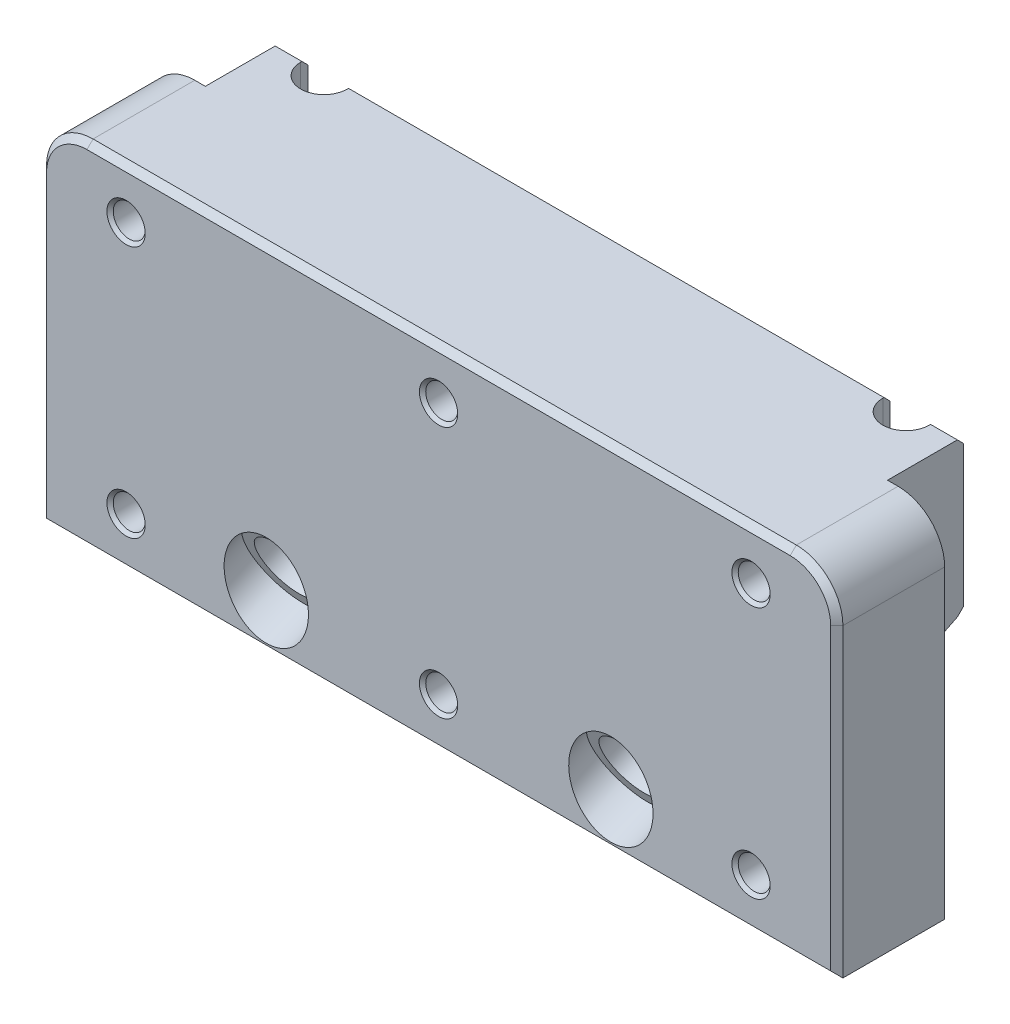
ISO-10303-21;
HEADER;
FILE_DESCRIPTION(('STEP AP214'),'2;1');
FILE_NAME('part.step','',(''),(''),'','','');
FILE_SCHEMA(('AUTOMOTIVE_DESIGN { 1 0 10303 214 1 1 1 1 }'));
ENDSEC;
DATA;
#1=APPLICATION_CONTEXT('core data for automotive mechanical design processes');
#2=APPLICATION_PROTOCOL_DEFINITION('international standard','automotive_design',2000,#1);
#3=PRODUCT_CONTEXT('',#1,'mechanical');
#4=PRODUCT('Part','Part','',(#3));
#5=PRODUCT_RELATED_PRODUCT_CATEGORY('part','',(#4));
#6=PRODUCT_DEFINITION_FORMATION('','',#4);
#7=PRODUCT_DEFINITION_CONTEXT('part definition',#1,'design');
#8=PRODUCT_DEFINITION('design','',#6,#7);
#9=PRODUCT_DEFINITION_SHAPE('','',#8);
#10=(LENGTH_UNIT() NAMED_UNIT(*) SI_UNIT(.MILLI.,.METRE.));
#11=(NAMED_UNIT(*) PLANE_ANGLE_UNIT() SI_UNIT($,.RADIAN.));
#12=(NAMED_UNIT(*) SI_UNIT($,.STERADIAN.) SOLID_ANGLE_UNIT());
#13=UNCERTAINTY_MEASURE_WITH_UNIT(LENGTH_MEASURE(1.E-05),#10,'distance_accuracy_value','');
#14=(GEOMETRIC_REPRESENTATION_CONTEXT(3) GLOBAL_UNCERTAINTY_ASSIGNED_CONTEXT((#13)) GLOBAL_UNIT_ASSIGNED_CONTEXT((#10,
#11,#12)) REPRESENTATION_CONTEXT('',''));
#15=CARTESIAN_POINT('',(0.,0.,0.));
#16=DIRECTION('',(0.,0.,1.));
#17=DIRECTION('',(1.,0.,0.));
#18=AXIS2_PLACEMENT_3D('',#15,#16,#17);
#19=CARTESIAN_POINT('',(0.,72.898,22.352));
#20=DIRECTION('',(0.,0.,-1.));
#21=DIRECTION('',(-1.,0.,0.));
#22=AXIS2_PLACEMENT_3D('',#19,#20,#21);
#23=PLANE('',#22);
#24=DIRECTION('',(0.999999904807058,-0.00043633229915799,0.));
#25=VECTOR('',#24,1.);
#26=CARTESIAN_POINT('',(-60.801250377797,10.2852683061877,22.352));
#27=LINE('',#26,#25);
#28=CARTESIAN_POINT('',(-60.8009963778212,10.2852681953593,22.352));
#29=VERTEX_POINT('',#28);
#30=CARTESIAN_POINT('',(-60.801250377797,10.2852683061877,22.352));
#31=VERTEX_POINT('',#30);
#32=EDGE_CURVE('E526',#29,#31,#27,.F.);
#33=ORIENTED_EDGE('',*,*,#32,.F.);
#34=CARTESIAN_POINT('',(-64.77,10.287,22.352));
#35=DIRECTION('',(0.,0.,1.));
#36=DIRECTION('',(1.,0.,0.));
#37=AXIS2_PLACEMENT_3D('',#34,#35,#36);
#38=CIRCLE('',#37,3.969004);
#39=CARTESIAN_POINT('',(-60.800996,10.287,22.352));
#40=VERTEX_POINT('',#39);
#41=EDGE_CURVE('E477',#40,#29,#38,.T.);
#42=ORIENTED_EDGE('',*,*,#41,.F.);
#43=DIRECTION('',(1.,0.,0.));
#44=VECTOR('',#43,1.);
#45=CARTESIAN_POINT('',(-60.80125,10.287,22.352));
#46=LINE('',#45,#44);
#47=CARTESIAN_POINT('',(-60.80125,10.287,22.352));
#48=VERTEX_POINT('',#47);
#49=EDGE_CURVE('E40',#40,#48,#46,.F.);
#50=ORIENTED_EDGE('',*,*,#49,.T.);
#51=CARTESIAN_POINT('',(-64.77,10.287,22.352));
#52=DIRECTION('',(0.,0.,-1.));
#53=DIRECTION('',(-1.,0.,0.));
#54=AXIS2_PLACEMENT_3D('',#51,#52,#53);
#55=CIRCLE('',#54,3.96875);
#56=EDGE_CURVE('E819',#48,#31,#55,.T.);
#57=ORIENTED_EDGE('',*,*,#56,.T.);
#58=EDGE_LOOP('',(#33,#42,#50,#57));
#59=FACE_BOUND('',#58,.T.);
#60=DIRECTION('',(0.999999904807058,-0.000436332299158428,0.));
#61=VECTOR('',#60,1.);
#62=CARTESIAN_POINT('',(68.738749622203,10.2852683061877,22.352));
#63=LINE('',#62,#61);
#64=CARTESIAN_POINT('',(68.7390036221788,10.2852681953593,22.352));
#65=VERTEX_POINT('',#64);
#66=CARTESIAN_POINT('',(68.738749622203,10.2852683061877,22.352));
#67=VERTEX_POINT('',#66);
#68=EDGE_CURVE('E1211',#65,#67,#63,.F.);
#69=ORIENTED_EDGE('',*,*,#68,.F.);
#70=CARTESIAN_POINT('',(64.77,10.287,22.352));
#71=DIRECTION('',(0.,0.,1.));
#72=DIRECTION('',(1.,0.,0.));
#73=AXIS2_PLACEMENT_3D('',#70,#71,#72);
#74=CIRCLE('',#73,3.969004);
#75=CARTESIAN_POINT('',(68.739004,10.287,22.352));
#76=VERTEX_POINT('',#75);
#77=EDGE_CURVE('E1136',#76,#65,#74,.T.);
#78=ORIENTED_EDGE('',*,*,#77,.F.);
#79=DIRECTION('',(1.,0.,0.));
#80=VECTOR('',#79,1.);
#81=CARTESIAN_POINT('',(68.73875,10.287,22.352));
#82=LINE('',#81,#80);
#83=CARTESIAN_POINT('',(68.73875,10.287,22.352));
#84=VERTEX_POINT('',#83);
#85=EDGE_CURVE('E1202',#76,#84,#82,.F.);
#86=ORIENTED_EDGE('',*,*,#85,.T.);
#87=CARTESIAN_POINT('',(64.77,10.287,22.352));
#88=DIRECTION('',(0.,0.,-1.));
#89=DIRECTION('',(-1.,0.,0.));
#90=AXIS2_PLACEMENT_3D('',#87,#88,#89);
#91=CIRCLE('',#90,3.96875);
#92=EDGE_CURVE('E809',#84,#67,#91,.T.);
#93=ORIENTED_EDGE('',*,*,#92,.T.);
#94=EDGE_LOOP('',(#69,#78,#86,#93));
#95=FACE_BOUND('',#94,.T.);
#96=DIRECTION('',(0.999999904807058,-0.000436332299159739,0.));
#97=VECTOR('',#96,1.);
#98=CARTESIAN_POINT('',(3.96874962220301,62.6092683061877,22.352));
#99=LINE('',#98,#97);
#100=CARTESIAN_POINT('',(3.96900362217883,62.6092681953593,22.352));
#101=VERTEX_POINT('',#100);
#102=CARTESIAN_POINT('',(3.96874962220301,62.6092683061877,22.352));
#103=VERTEX_POINT('',#102);
#104=EDGE_CURVE('E834',#101,#103,#99,.F.);
#105=ORIENTED_EDGE('',*,*,#104,.F.);
#106=CARTESIAN_POINT('',(0.,62.611,22.352));
#107=DIRECTION('',(0.,0.,1.));
#108=DIRECTION('',(1.,0.,0.));
#109=AXIS2_PLACEMENT_3D('',#106,#107,#108);
#110=CIRCLE('',#109,3.969004);
#111=CARTESIAN_POINT('',(3.969004,62.611,22.352));
#112=VERTEX_POINT('',#111);
#113=EDGE_CURVE('E2373',#112,#101,#110,.T.);
#114=ORIENTED_EDGE('',*,*,#113,.F.);
#115=DIRECTION('',(1.,0.,0.));
#116=VECTOR('',#115,1.);
#117=CARTESIAN_POINT('',(3.96875,62.611,22.352));
#118=LINE('',#117,#116);
#119=CARTESIAN_POINT('',(3.96875,62.611,22.352));
#120=VERTEX_POINT('',#119);
#121=EDGE_CURVE('E838',#112,#120,#118,.F.);
#122=ORIENTED_EDGE('',*,*,#121,.T.);
#123=CARTESIAN_POINT('',(0.,62.611,22.352));
#124=DIRECTION('',(0.,0.,-1.));
#125=DIRECTION('',(-1.,0.,0.));
#126=AXIS2_PLACEMENT_3D('',#123,#124,#125);
#127=CIRCLE('',#126,3.96875);
#128=EDGE_CURVE('E533',#120,#103,#127,.T.);
#129=ORIENTED_EDGE('',*,*,#128,.T.);
#130=EDGE_LOOP('',(#105,#114,#122,#129));
#131=FACE_BOUND('',#130,.T.);
#132=DIRECTION('',(-1.,0.,0.));
#133=VECTOR('',#132,1.);
#134=CARTESIAN_POINT('',(0.,71.628,22.352));
#135=LINE('',#134,#133);
#136=CARTESIAN_POINT('',(72.8853,71.628,22.352));
#137=VERTEX_POINT('',#136);
#138=CARTESIAN_POINT('',(-72.8853,71.628,22.352));
#139=VERTEX_POINT('',#138);
#140=EDGE_CURVE('E757',#137,#139,#135,.T.);
#141=ORIENTED_EDGE('',*,*,#140,.T.);
#142=CARTESIAN_POINT('',(-72.8853,63.246,22.352));
#143=DIRECTION('',(0.,0.,-1.));
#144=DIRECTION('',(-1.,0.,0.));
#145=AXIS2_PLACEMENT_3D('',#142,#143,#144);
#146=CIRCLE('',#145,8.382);
#147=CARTESIAN_POINT('',(-81.2673,63.246,22.352));
#148=VERTEX_POINT('',#147);
#149=EDGE_CURVE('E763',#139,#148,#146,.F.);
#150=ORIENTED_EDGE('',*,*,#149,.T.);
#151=DIRECTION('',(0.,-1.,0.));
#152=VECTOR('',#151,1.);
#153=CARTESIAN_POINT('',(-81.2673,0.,22.352));
#154=LINE('',#153,#152);
#155=CARTESIAN_POINT('',(-81.2673,1.27,22.352));
#156=VERTEX_POINT('',#155);
#157=EDGE_CURVE('E761',#148,#156,#154,.T.);
#158=ORIENTED_EDGE('',*,*,#157,.T.);
#159=DIRECTION('',(1.,0.,0.));
#160=VECTOR('',#159,1.);
#161=CARTESIAN_POINT('',(82.5373,1.27,22.352));
#162=LINE('',#161,#160);
#163=CARTESIAN_POINT('',(81.2673,1.27,22.352));
#164=VERTEX_POINT('',#163);
#165=EDGE_CURVE('E759',#156,#164,#162,.T.);
#166=ORIENTED_EDGE('',*,*,#165,.T.);
#167=DIRECTION('',(0.,1.,0.));
#168=VECTOR('',#167,1.);
#169=CARTESIAN_POINT('',(81.2673,72.898,22.352));
#170=LINE('',#169,#168);
#171=CARTESIAN_POINT('',(81.2673,63.246,22.352));
#172=VERTEX_POINT('',#171);
#173=EDGE_CURVE('E753',#164,#172,#170,.T.);
#174=ORIENTED_EDGE('',*,*,#173,.T.);
#175=CARTESIAN_POINT('',(72.8853,63.246,22.352));
#176=DIRECTION('',(0.,0.,-1.));
#177=DIRECTION('',(-1.,0.,0.));
#178=AXIS2_PLACEMENT_3D('',#175,#176,#177);
#179=CIRCLE('',#178,8.382);
#180=EDGE_CURVE('E755',#172,#137,#179,.F.);
#181=ORIENTED_EDGE('',*,*,#180,.T.);
#182=EDGE_LOOP('',(#141,#150,#158,#166,#174,#181));
#183=FACE_BOUND('',#182,.T.);
#184=CARTESIAN_POINT('',(-35.7124,11.0937104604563,22.352));
#185=DIRECTION('',(0.,0.,-1.));
#186=DIRECTION('',(0.,1.,0.));
#187=AXIS2_PLACEMENT_3D('',#184,#185,#186);
#188=ELLIPSE('',#187,9.49218243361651,8.7376);
#189=CARTESIAN_POINT('',(-35.7124,20.5858928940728,22.352));
#190=VERTEX_POINT('',#189);
#191=EDGE_CURVE('E695',#190,#190,#188,.F.);
#192=ORIENTED_EDGE('',*,*,#191,.F.);
#193=EDGE_LOOP('',(#192));
#194=FACE_BOUND('',#193,.T.);
#195=CARTESIAN_POINT('',(35.7124,11.0937104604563,22.352));
#196=DIRECTION('',(0.,0.,-1.));
#197=DIRECTION('',(0.,1.,0.));
#198=AXIS2_PLACEMENT_3D('',#195,#196,#197);
#199=ELLIPSE('',#198,9.49218243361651,8.7376);
#200=CARTESIAN_POINT('',(35.7124,20.5858928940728,22.352));
#201=VERTEX_POINT('',#200);
#202=EDGE_CURVE('E693',#201,#201,#199,.F.);
#203=ORIENTED_EDGE('',*,*,#202,.F.);
#204=EDGE_LOOP('',(#203));
#205=FACE_BOUND('',#204,.T.);
#206=DIRECTION('',(0.999999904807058,-0.000436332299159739,0.));
#207=VECTOR('',#206,1.);
#208=CARTESIAN_POINT('',(-60.801250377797,62.6092683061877,22.352));
#209=LINE('',#208,#207);
#210=CARTESIAN_POINT('',(-60.8009963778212,62.6092681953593,22.352));
#211=VERTEX_POINT('',#210);
#212=CARTESIAN_POINT('',(-60.801250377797,62.6092683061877,22.352));
#213=VERTEX_POINT('',#212);
#214=EDGE_CURVE('E1119',#211,#213,#209,.F.);
#215=ORIENTED_EDGE('',*,*,#214,.F.);
#216=CARTESIAN_POINT('',(-64.77,62.611,22.352));
#217=DIRECTION('',(0.,0.,1.));
#218=DIRECTION('',(1.,0.,0.));
#219=AXIS2_PLACEMENT_3D('',#216,#217,#218);
#220=CIRCLE('',#219,3.969004);
#221=CARTESIAN_POINT('',(-60.800996,62.611,22.352));
#222=VERTEX_POINT('',#221);
#223=EDGE_CURVE('E2443',#222,#211,#220,.T.);
#224=ORIENTED_EDGE('',*,*,#223,.F.);
#225=DIRECTION('',(1.,0.,0.));
#226=VECTOR('',#225,1.);
#227=CARTESIAN_POINT('',(-60.80125,62.611,22.352));
#228=LINE('',#227,#226);
#229=CARTESIAN_POINT('',(-60.80125,62.611,22.352));
#230=VERTEX_POINT('',#229);
#231=EDGE_CURVE('E2338',#222,#230,#228,.F.);
#232=ORIENTED_EDGE('',*,*,#231,.T.);
#233=CARTESIAN_POINT('',(-64.77,62.611,22.352));
#234=DIRECTION('',(0.,0.,-1.));
#235=DIRECTION('',(-1.,0.,0.));
#236=AXIS2_PLACEMENT_3D('',#233,#234,#235);
#237=CIRCLE('',#236,3.96875);
#238=EDGE_CURVE('E804',#230,#213,#237,.T.);
#239=ORIENTED_EDGE('',*,*,#238,.T.);
#240=EDGE_LOOP('',(#215,#224,#232,#239));
#241=FACE_BOUND('',#240,.T.);
#242=DIRECTION('',(0.999999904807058,-0.00043633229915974,0.));
#243=VECTOR('',#242,1.);
#244=CARTESIAN_POINT('',(68.738749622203,62.6092683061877,22.352));
#245=LINE('',#244,#243);
#246=CARTESIAN_POINT('',(68.7390036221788,62.6092681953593,22.352));
#247=VERTEX_POINT('',#246);
#248=CARTESIAN_POINT('',(68.738749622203,62.6092683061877,22.352));
#249=VERTEX_POINT('',#248);
#250=EDGE_CURVE('E1124',#247,#249,#245,.F.);
#251=ORIENTED_EDGE('',*,*,#250,.F.);
#252=CARTESIAN_POINT('',(64.77,62.611,22.352));
#253=DIRECTION('',(0.,0.,1.));
#254=DIRECTION('',(1.,0.,0.));
#255=AXIS2_PLACEMENT_3D('',#252,#253,#254);
#256=CIRCLE('',#255,3.969004);
#257=CARTESIAN_POINT('',(68.739004,62.611,22.352));
#258=VERTEX_POINT('',#257);
#259=EDGE_CURVE('E1127',#258,#247,#256,.T.);
#260=ORIENTED_EDGE('',*,*,#259,.F.);
#261=DIRECTION('',(1.,0.,0.));
#262=VECTOR('',#261,1.);
#263=CARTESIAN_POINT('',(68.73875,62.611,22.352));
#264=LINE('',#263,#262);
#265=CARTESIAN_POINT('',(68.73875,62.611,22.352));
#266=VERTEX_POINT('',#265);
#267=EDGE_CURVE('E1133',#258,#266,#264,.F.);
#268=ORIENTED_EDGE('',*,*,#267,.T.);
#269=CARTESIAN_POINT('',(64.77,62.611,22.352));
#270=DIRECTION('',(0.,0.,-1.));
#271=DIRECTION('',(-1.,0.,0.));
#272=AXIS2_PLACEMENT_3D('',#269,#270,#271);
#273=CIRCLE('',#272,3.96875);
#274=EDGE_CURVE('E532',#266,#249,#273,.T.);
#275=ORIENTED_EDGE('',*,*,#274,.T.);
#276=EDGE_LOOP('',(#251,#260,#268,#275));
#277=FACE_BOUND('',#276,.T.);
#278=DIRECTION('',(0.999999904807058,-0.000436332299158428,0.));
#279=VECTOR('',#278,1.);
#280=CARTESIAN_POINT('',(3.96874962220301,10.2852683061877,22.352));
#281=LINE('',#280,#279);
#282=CARTESIAN_POINT('',(3.96900362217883,10.2852681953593,22.352));
#283=VERTEX_POINT('',#282);
#284=CARTESIAN_POINT('',(3.96874962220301,10.2852683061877,22.352));
#285=VERTEX_POINT('',#284);
#286=EDGE_CURVE('E499',#283,#285,#281,.F.);
#287=ORIENTED_EDGE('',*,*,#286,.F.);
#288=CARTESIAN_POINT('',(0.,10.287,22.352));
#289=DIRECTION('',(0.,0.,1.));
#290=DIRECTION('',(1.,0.,0.));
#291=AXIS2_PLACEMENT_3D('',#288,#289,#290);
#292=CIRCLE('',#291,3.969004);
#293=CARTESIAN_POINT('',(3.969004,10.287,22.352));
#294=VERTEX_POINT('',#293);
#295=EDGE_CURVE('E561',#294,#283,#292,.T.);
#296=ORIENTED_EDGE('',*,*,#295,.F.);
#297=DIRECTION('',(1.,0.,0.));
#298=VECTOR('',#297,1.);
#299=CARTESIAN_POINT('',(3.96875,10.287,22.352));
#300=LINE('',#299,#298);
#301=CARTESIAN_POINT('',(3.96875,10.287,22.352));
#302=VERTEX_POINT('',#301);
#303=EDGE_CURVE('E19',#294,#302,#300,.F.);
#304=ORIENTED_EDGE('',*,*,#303,.T.);
#305=CARTESIAN_POINT('',(0.,10.287,22.352));
#306=DIRECTION('',(0.,0.,-1.));
#307=DIRECTION('',(-1.,0.,0.));
#308=AXIS2_PLACEMENT_3D('',#305,#306,#307);
#309=CIRCLE('',#308,3.96875);
#310=EDGE_CURVE('E529',#302,#285,#309,.T.);
#311=ORIENTED_EDGE('',*,*,#310,.T.);
#312=EDGE_LOOP('',(#287,#296,#304,#311));
#313=FACE_BOUND('',#312,.T.);
#314=ADVANCED_FACE('F15',(#59,#95,#131,#183,#194,#205,#241,#277,#313),#23,.F.);
#315=CARTESIAN_POINT('',(70.7009,72.898,-15.748));
#316=DIRECTION('',(0.,0.,1.));
#317=DIRECTION('',(1.,0.,0.));
#318=AXIS2_PLACEMENT_3D('',#315,#316,#317);
#319=PLANE('',#318);
#320=DIRECTION('',(0.,-1.,0.));
#321=VECTOR('',#320,1.);
#322=CARTESIAN_POINT('',(55.499,72.898,-15.748));
#323=LINE('',#322,#321);
#324=CARTESIAN_POINT('',(55.499,71.628,-15.748));
#325=VERTEX_POINT('',#324);
#326=CARTESIAN_POINT('',(55.499,42.3653663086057,-15.748));
#327=VERTEX_POINT('',#326);
#328=EDGE_CURVE('E917',#325,#327,#323,.T.);
#329=ORIENTED_EDGE('',*,*,#328,.T.);
#330=DIRECTION('',(-1.,0.,0.));
#331=VECTOR('',#330,1.);
#332=CARTESIAN_POINT('',(70.7009,42.3653663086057,-15.748));
#333=LINE('',#332,#331);
#334=CARTESIAN_POINT('',(-55.499,42.3653663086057,-15.748));
#335=VERTEX_POINT('',#334);
#336=EDGE_CURVE('E787',#327,#335,#333,.T.);
#337=ORIENTED_EDGE('',*,*,#336,.T.);
#338=DIRECTION('',(0.,1.,0.));
#339=VECTOR('',#338,1.);
#340=CARTESIAN_POINT('',(-55.499,72.898,-15.748));
#341=LINE('',#340,#339);
#342=CARTESIAN_POINT('',(-55.499,71.628,-15.748));
#343=VERTEX_POINT('',#342);
#344=EDGE_CURVE('E901',#335,#343,#341,.T.);
#345=ORIENTED_EDGE('',*,*,#344,.T.);
#346=DIRECTION('',(1.,0.,0.));
#347=VECTOR('',#346,1.);
#348=CARTESIAN_POINT('',(70.7009,71.628,-15.748));
#349=LINE('',#348,#347);
#350=EDGE_CURVE('E746',#343,#325,#349,.T.);
#351=ORIENTED_EDGE('',*,*,#350,.T.);
#352=EDGE_LOOP('',(#329,#337,#345,#351));
#353=FACE_BOUND('',#352,.T.);
#354=ADVANCED_FACE('F598',(#353),#319,.F.);
#355=DIRECTION('',(0.,-1.,0.));
#356=VECTOR('',#355,1.);
#357=CARTESIAN_POINT('',(-65.151,72.898,-15.748));
#358=LINE('',#357,#356);
#359=CARTESIAN_POINT('',(-65.151,71.628,-15.748));
#360=VERTEX_POINT('',#359);
#361=CARTESIAN_POINT('',(-65.151,42.3653663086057,-15.748));
#362=VERTEX_POINT('',#361);
#363=EDGE_CURVE('E898',#360,#362,#358,.T.);
#364=ORIENTED_EDGE('',*,*,#363,.T.);
#365=DIRECTION('',(-1.,0.,0.));
#366=VECTOR('',#365,1.);
#367=CARTESIAN_POINT('',(70.7009,42.3653663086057,-15.748));
#368=LINE('',#367,#366);
#369=CARTESIAN_POINT('',(-70.7009,42.3653663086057,-15.748));
#370=VERTEX_POINT('',#369);
#371=EDGE_CURVE('E774',#362,#370,#368,.T.);
#372=ORIENTED_EDGE('',*,*,#371,.T.);
#373=DIRECTION('',(0.,-1.,0.));
#374=VECTOR('',#373,1.);
#375=CARTESIAN_POINT('',(-70.7009,72.898,-15.748));
#376=LINE('',#375,#374);
#377=CARTESIAN_POINT('',(-70.7009,71.628,-15.748));
#378=VERTEX_POINT('',#377);
#379=EDGE_CURVE('E948',#378,#370,#376,.T.);
#380=ORIENTED_EDGE('',*,*,#379,.F.);
#381=DIRECTION('',(1.,0.,0.));
#382=VECTOR('',#381,1.);
#383=CARTESIAN_POINT('',(70.7009,71.628,-15.748));
#384=LINE('',#383,#382);
#385=EDGE_CURVE('E739',#378,#360,#384,.T.);
#386=ORIENTED_EDGE('',*,*,#385,.T.);
#387=EDGE_LOOP('',(#364,#372,#380,#386));
#388=FACE_BOUND('',#387,.T.);
#389=ADVANCED_FACE('F604',(#388),#319,.F.);
#390=CARTESIAN_POINT('',(-82.5373,0.,22.352));
#391=DIRECTION('',(0.,-1.,0.));
#392=DIRECTION('',(0.,0.,-1.));
#393=AXIS2_PLACEMENT_3D('',#390,#391,#392);
#394=PLANE('',#393);
#395=DIRECTION('',(0.,0.,-1.));
#396=VECTOR('',#395,1.);
#397=CARTESIAN_POINT('',(82.5373,0.,22.352));
#398=LINE('',#397,#396);
#399=CARTESIAN_POINT('',(82.5373,0.,21.082));
#400=VERTEX_POINT('',#399);
#401=CARTESIAN_POINT('',(82.5373,0.,0.));
#402=VERTEX_POINT('',#401);
#403=EDGE_CURVE('E932',#400,#402,#398,.T.);
#404=ORIENTED_EDGE('',*,*,#403,.F.);
#405=DIRECTION('',(-1.,0.,0.));
#406=VECTOR('',#405,1.);
#407=CARTESIAN_POINT('',(-82.5373,0.,21.082));
#408=LINE('',#407,#406);
#409=CARTESIAN_POINT('',(-82.5373,0.,21.082));
#410=VERTEX_POINT('',#409);
#411=EDGE_CURVE('E768',#400,#410,#408,.T.);
#412=ORIENTED_EDGE('',*,*,#411,.T.);
#413=DIRECTION('',(0.,0.,-1.));
#414=VECTOR('',#413,1.);
#415=CARTESIAN_POINT('',(-82.5373,0.,22.352));
#416=LINE('',#415,#414);
#417=CARTESIAN_POINT('',(-82.5373,0.,0.));
#418=VERTEX_POINT('',#417);
#419=EDGE_CURVE('E928',#410,#418,#416,.T.);
#420=ORIENTED_EDGE('',*,*,#419,.T.);
#421=DIRECTION('',(-1.,0.,0.));
#422=VECTOR('',#421,1.);
#423=CARTESIAN_POINT('',(82.5373,0.,0.));
#424=LINE('',#423,#422);
#425=EDGE_CURVE('E929',#402,#418,#424,.T.);
#426=ORIENTED_EDGE('',*,*,#425,.F.);
#427=EDGE_LOOP('',(#404,#412,#420,#426));
#428=FACE_BOUND('',#427,.T.);
#429=ADVANCED_FACE('F632',(#428),#394,.T.);
#430=CARTESIAN_POINT('',(-70.7009,72.898,0.));
#431=DIRECTION('',(-1.,0.,0.));
#432=DIRECTION('',(0.,0.,1.));
#433=AXIS2_PLACEMENT_3D('',#430,#431,#432);
#434=PLANE('',#433);
#435=ORIENTED_EDGE('',*,*,#379,.T.);
#436=DIRECTION('',(0.,0.707106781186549,-0.707106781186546));
#437=VECTOR('',#436,1.);
#438=CARTESIAN_POINT('',(-70.7009,49.7576831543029,-23.1403168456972));
#439=LINE('',#438,#437);
#440=CARTESIAN_POINT('',(-70.7009,41.1009876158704,-14.4836213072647));
#441=VERTEX_POINT('',#440);
#442=EDGE_CURVE('E777',#370,#441,#439,.F.);
#443=ORIENTED_EDGE('',*,*,#442,.T.);
#444=DIRECTION('',(0.,0.438371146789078,-0.898794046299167));
#445=VECTOR('',#444,1.);
#446=CARTESIAN_POINT('',(-70.7009,41.5047713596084,-15.3115006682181));
#447=LINE('',#446,#445);
#448=CARTESIAN_POINT('',(-70.7009,34.7326222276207,-1.42653728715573));
#449=VERTEX_POINT('',#448);
#450=EDGE_CURVE('E925',#449,#441,#447,.T.);
#451=ORIENTED_EDGE('',*,*,#450,.F.);
#452=CARTESIAN_POINT('',(-70.7009,32.4496853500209,-2.54));
#453=DIRECTION('',(-1.,0.,0.));
#454=DIRECTION('',(0.,0.,1.));
#455=AXIS2_PLACEMENT_3D('',#452,#453,#454);
#456=CIRCLE('',#455,2.54);
#457=CARTESIAN_POINT('',(-70.7009,32.4496853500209,0.));
#458=VERTEX_POINT('',#457);
#459=EDGE_CURVE('E714',#449,#458,#456,.F.);
#460=ORIENTED_EDGE('',*,*,#459,.T.);
#461=DIRECTION('',(0.,-1.,0.));
#462=VECTOR('',#461,1.);
#463=CARTESIAN_POINT('',(-70.7009,72.898,0.));
#464=LINE('',#463,#462);
#465=CARTESIAN_POINT('',(-70.7009,72.898,0.));
#466=VERTEX_POINT('',#465);
#467=EDGE_CURVE('E946',#466,#458,#464,.T.);
#468=ORIENTED_EDGE('',*,*,#467,.F.);
#469=DIRECTION('',(0.,0.,1.));
#470=VECTOR('',#469,1.);
#471=CARTESIAN_POINT('',(-70.7009,72.898,0.));
#472=LINE('',#471,#470);
#473=CARTESIAN_POINT('',(-70.7009,72.898,-14.478));
#474=VERTEX_POINT('',#473);
#475=EDGE_CURVE('E892',#474,#466,#472,.T.);
#476=ORIENTED_EDGE('',*,*,#475,.F.);
#477=DIRECTION('',(0.,0.707106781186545,0.707106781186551));
#478=VECTOR('',#477,1.);
#479=CARTESIAN_POINT('',(-70.7009,80.137,-7.239));
#480=LINE('',#479,#478);
#481=EDGE_CURVE('E737',#474,#378,#480,.F.);
#482=ORIENTED_EDGE('',*,*,#481,.T.);
#483=EDGE_LOOP('',(#435,#443,#451,#460,#468,#476,#482));
#484=FACE_BOUND('',#483,.T.);
#485=ADVANCED_FACE('F625',(#484),#434,.T.);
#486=CARTESIAN_POINT('',(70.7009,72.898,0.));
#487=DIRECTION('',(-1.,0.,0.));
#488=DIRECTION('',(0.,0.,1.));
#489=AXIS2_PLACEMENT_3D('',#486,#487,#488);
#490=PLANE('',#489);
#491=DIRECTION('',(0.,0.438371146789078,-0.898794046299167));
#492=VECTOR('',#491,1.);
#493=CARTESIAN_POINT('',(70.7009,41.5047713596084,-15.3115006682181));
#494=LINE('',#493,#492);
#495=CARTESIAN_POINT('',(70.7009,34.7326222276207,-1.42653728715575));
#496=VERTEX_POINT('',#495);
#497=CARTESIAN_POINT('',(70.7009,41.1009876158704,-14.4836213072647));
#498=VERTEX_POINT('',#497);
#499=EDGE_CURVE('E922',#496,#498,#494,.T.);
#500=ORIENTED_EDGE('',*,*,#499,.T.);
#501=DIRECTION('',(0.,-0.707106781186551,0.707106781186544));
#502=VECTOR('',#501,1.);
#503=CARTESIAN_POINT('',(70.7009,42.3653663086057,-15.748));
#504=LINE('',#503,#502);
#505=CARTESIAN_POINT('',(70.7009,42.3653663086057,-15.748));
#506=VERTEX_POINT('',#505);
#507=EDGE_CURVE('E799',#498,#506,#504,.F.);
#508=ORIENTED_EDGE('',*,*,#507,.T.);
#509=DIRECTION('',(0.,-1.,0.));
#510=VECTOR('',#509,1.);
#511=CARTESIAN_POINT('',(70.7009,72.898,-15.748));
#512=LINE('',#511,#510);
#513=CARTESIAN_POINT('',(70.7009,71.628,-15.748));
#514=VERTEX_POINT('',#513);
#515=EDGE_CURVE('E951',#514,#506,#512,.T.);
#516=ORIENTED_EDGE('',*,*,#515,.F.);
#517=DIRECTION('',(0.,-0.707106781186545,-0.707106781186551));
#518=VECTOR('',#517,1.);
#519=CARTESIAN_POINT('',(70.7009,72.898,-14.478));
#520=LINE('',#519,#518);
#521=CARTESIAN_POINT('',(70.7009,72.898,-14.478));
#522=VERTEX_POINT('',#521);
#523=EDGE_CURVE('E735',#514,#522,#520,.F.);
#524=ORIENTED_EDGE('',*,*,#523,.T.);
#525=DIRECTION('',(0.,0.,-1.));
#526=VECTOR('',#525,1.);
#527=CARTESIAN_POINT('',(70.7009,72.898,0.));
#528=LINE('',#527,#526);
#529=CARTESIAN_POINT('',(70.7009,72.898,0.));
#530=VERTEX_POINT('',#529);
#531=EDGE_CURVE('E936',#530,#522,#528,.T.);
#532=ORIENTED_EDGE('',*,*,#531,.F.);
#533=DIRECTION('',(0.,-1.,0.));
#534=VECTOR('',#533,1.);
#535=CARTESIAN_POINT('',(70.7009,72.898,0.));
#536=LINE('',#535,#534);
#537=CARTESIAN_POINT('',(70.7009,32.4496853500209,0.));
#538=VERTEX_POINT('',#537);
#539=EDGE_CURVE('E954',#530,#538,#536,.T.);
#540=ORIENTED_EDGE('',*,*,#539,.T.);
#541=CARTESIAN_POINT('',(70.7009,32.4496853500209,-2.54));
#542=DIRECTION('',(-1.,0.,0.));
#543=DIRECTION('',(0.,0.,1.));
#544=AXIS2_PLACEMENT_3D('',#541,#542,#543);
#545=CIRCLE('',#544,2.54);
#546=EDGE_CURVE('E717',#538,#496,#545,.T.);
#547=ORIENTED_EDGE('',*,*,#546,.T.);
#548=EDGE_LOOP('',(#500,#508,#516,#524,#532,#540,#547));
#549=FACE_BOUND('',#548,.T.);
#550=ADVANCED_FACE('F623',(#549),#490,.F.);
#551=ORIENTED_EDGE('',*,*,#515,.T.);
#552=DIRECTION('',(-1.,0.,0.));
#553=VECTOR('',#552,1.);
#554=CARTESIAN_POINT('',(70.7009,42.3653663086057,-15.748));
#555=LINE('',#554,#553);
#556=CARTESIAN_POINT('',(65.151,42.3653663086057,-15.748));
#557=VERTEX_POINT('',#556);
#558=EDGE_CURVE('E794',#506,#557,#555,.T.);
#559=ORIENTED_EDGE('',*,*,#558,.T.);
#560=DIRECTION('',(0.,1.,0.));
#561=VECTOR('',#560,1.);
#562=CARTESIAN_POINT('',(65.151,72.898,-15.748));
#563=LINE('',#562,#561);
#564=CARTESIAN_POINT('',(65.151,71.628,-15.748));
#565=VERTEX_POINT('',#564);
#566=EDGE_CURVE('E913',#557,#565,#563,.T.);
#567=ORIENTED_EDGE('',*,*,#566,.T.);
#568=DIRECTION('',(1.,0.,0.));
#569=VECTOR('',#568,1.);
#570=CARTESIAN_POINT('',(70.7009,71.628,-15.748));
#571=LINE('',#570,#569);
#572=EDGE_CURVE('E733',#565,#514,#571,.T.);
#573=ORIENTED_EDGE('',*,*,#572,.T.);
#574=EDGE_LOOP('',(#551,#559,#567,#573));
#575=FACE_BOUND('',#574,.T.);
#576=ADVANCED_FACE('F607',(#575),#319,.F.);
#577=CARTESIAN_POINT('',(-82.5373,72.898,22.352));
#578=DIRECTION('',(-1.,0.,0.));
#579=DIRECTION('',(0.,0.,1.));
#580=AXIS2_PLACEMENT_3D('',#577,#578,#579);
#581=PLANE('',#580);
#582=ORIENTED_EDGE('',*,*,#419,.F.);
#583=DIRECTION('',(0.,1.,0.));
#584=VECTOR('',#583,1.);
#585=CARTESIAN_POINT('',(-82.5373,63.246,21.082));
#586=LINE('',#585,#584);
#587=CARTESIAN_POINT('',(-82.5373,63.246,21.082));
#588=VERTEX_POINT('',#587);
#589=EDGE_CURVE('E766',#410,#588,#586,.T.);
#590=ORIENTED_EDGE('',*,*,#589,.T.);
#591=DIRECTION('',(0.,0.,-1.));
#592=VECTOR('',#591,1.);
#593=CARTESIAN_POINT('',(-82.5373,63.246,0.));
#594=LINE('',#593,#592);
#595=CARTESIAN_POINT('',(-82.5373,63.246,0.));
#596=VERTEX_POINT('',#595);
#597=EDGE_CURVE('E972',#588,#596,#594,.T.);
#598=ORIENTED_EDGE('',*,*,#597,.T.);
#599=DIRECTION('',(0.,-1.,0.));
#600=VECTOR('',#599,1.);
#601=CARTESIAN_POINT('',(-82.5373,72.898,0.));
#602=LINE('',#601,#600);
#603=EDGE_CURVE('E942',#596,#418,#602,.T.);
#604=ORIENTED_EDGE('',*,*,#603,.T.);
#605=EDGE_LOOP('',(#582,#590,#598,#604));
#606=FACE_BOUND('',#605,.T.);
#607=ADVANCED_FACE('F621',(#606),#581,.T.);
#608=CARTESIAN_POINT('',(82.5373,72.898,0.));
#609=DIRECTION('',(0.,0.,1.));
#610=DIRECTION('',(1.,0.,0.));
#611=AXIS2_PLACEMENT_3D('',#608,#609,#610);
#612=PLANE('',#611);
#613=CARTESIAN_POINT('',(-35.7124,20.5815715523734,0.));
#614=DIRECTION('',(0.,0.,1.));
#615=DIRECTION('',(0.,-1.,0.));
#616=AXIS2_PLACEMENT_3D('',#613,#614,#615);
#617=ELLIPSE('',#616,6.90528678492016,6.35635);
#618=CARTESIAN_POINT('',(-35.7124,13.6762847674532,0.));
#619=VERTEX_POINT('',#618);
#620=EDGE_CURVE('E702',#619,#619,#617,.T.);
#621=ORIENTED_EDGE('',*,*,#620,.T.);
#622=EDGE_LOOP('',(#621));
#623=FACE_BOUND('',#622,.T.);
#624=CARTESIAN_POINT('',(35.7124,20.5815715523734,0.));
#625=DIRECTION('',(0.,0.,1.));
#626=DIRECTION('',(0.,-1.,0.));
#627=AXIS2_PLACEMENT_3D('',#624,#625,#626);
#628=ELLIPSE('',#627,6.90528678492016,6.35635);
#629=CARTESIAN_POINT('',(35.7124,13.6762847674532,0.));
#630=VERTEX_POINT('',#629);
#631=EDGE_CURVE('E688',#630,#630,#628,.T.);
#632=ORIENTED_EDGE('',*,*,#631,.T.);
#633=EDGE_LOOP('',(#632));
#634=FACE_BOUND('',#633,.T.);
#635=ORIENTED_EDGE('',*,*,#467,.T.);
#636=DIRECTION('',(-1.,0.,0.));
#637=VECTOR('',#636,1.);
#638=CARTESIAN_POINT('',(70.7009,32.4496853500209,0.));
#639=LINE('',#638,#637);
#640=EDGE_CURVE('E710',#458,#538,#639,.F.);
#641=ORIENTED_EDGE('',*,*,#640,.T.);
#642=ORIENTED_EDGE('',*,*,#539,.F.);
#643=DIRECTION('',(-1.,0.,0.));
#644=VECTOR('',#643,1.);
#645=CARTESIAN_POINT('',(82.5373,72.898,0.));
#646=LINE('',#645,#644);
#647=CARTESIAN_POINT('',(72.8853,72.898,0.));
#648=VERTEX_POINT('',#647);
#649=EDGE_CURVE('E933',#648,#530,#646,.T.);
#650=ORIENTED_EDGE('',*,*,#649,.F.);
#651=CARTESIAN_POINT('',(72.8853,63.246,0.));
#652=DIRECTION('',(0.,0.,1.));
#653=DIRECTION('',(1.,0.,0.));
#654=AXIS2_PLACEMENT_3D('',#651,#652,#653);
#655=CIRCLE('',#654,9.652);
#656=CARTESIAN_POINT('',(82.5373,63.246,0.));
#657=VERTEX_POINT('',#656);
#658=EDGE_CURVE('E962',#648,#657,#655,.F.);
#659=ORIENTED_EDGE('',*,*,#658,.T.);
#660=DIRECTION('',(0.,-1.,0.));
#661=VECTOR('',#660,1.);
#662=CARTESIAN_POINT('',(82.5373,72.898,0.));
#663=LINE('',#662,#661);
#664=EDGE_CURVE('E935',#657,#402,#663,.T.);
#665=ORIENTED_EDGE('',*,*,#664,.T.);
#666=ORIENTED_EDGE('',*,*,#425,.T.);
#667=ORIENTED_EDGE('',*,*,#603,.F.);
#668=CARTESIAN_POINT('',(-72.8853,63.246,0.));
#669=DIRECTION('',(0.,0.,1.));
#670=DIRECTION('',(1.,0.,0.));
#671=AXIS2_PLACEMENT_3D('',#668,#669,#670);
#672=CIRCLE('',#671,9.652);
#673=CARTESIAN_POINT('',(-72.8853,72.898,0.));
#674=VERTEX_POINT('',#673);
#675=EDGE_CURVE('E960',#596,#674,#672,.F.);
#676=ORIENTED_EDGE('',*,*,#675,.T.);
#677=DIRECTION('',(1.,0.,0.));
#678=VECTOR('',#677,1.);
#679=CARTESIAN_POINT('',(-82.5373,72.898,0.));
#680=LINE('',#679,#678);
#681=EDGE_CURVE('E939',#674,#466,#680,.T.);
#682=ORIENTED_EDGE('',*,*,#681,.T.);
#683=EDGE_LOOP('',(#635,#641,#642,#650,#659,#665,#666,#667,#676,#682));
#684=FACE_BOUND('',#683,.T.);
#685=ADVANCED_FACE('F617',(#623,#634,#684),#612,.F.);
#686=CARTESIAN_POINT('',(82.5373,72.898,22.352));
#687=DIRECTION('',(-1.,0.,0.));
#688=DIRECTION('',(0.,0.,1.));
#689=AXIS2_PLACEMENT_3D('',#686,#687,#688);
#690=PLANE('',#689);
#691=DIRECTION('',(0.,0.,-1.));
#692=VECTOR('',#691,1.);
#693=CARTESIAN_POINT('',(82.5373,63.246,22.352));
#694=LINE('',#693,#692);
#695=CARTESIAN_POINT('',(82.5373,63.246,21.082));
#696=VERTEX_POINT('',#695);
#697=EDGE_CURVE('E965',#657,#696,#694,.F.);
#698=ORIENTED_EDGE('',*,*,#697,.T.);
#699=DIRECTION('',(0.,-1.,0.));
#700=VECTOR('',#699,1.);
#701=CARTESIAN_POINT('',(82.5373,72.898,21.082));
#702=LINE('',#701,#700);
#703=EDGE_CURVE('E772',#696,#400,#702,.T.);
#704=ORIENTED_EDGE('',*,*,#703,.T.);
#705=ORIENTED_EDGE('',*,*,#403,.T.);
#706=ORIENTED_EDGE('',*,*,#664,.F.);
#707=EDGE_LOOP('',(#698,#704,#705,#706));
#708=FACE_BOUND('',#707,.T.);
#709=ADVANCED_FACE('F614',(#708),#690,.F.);
#710=CARTESIAN_POINT('',(-82.5373,72.898,22.352));
#711=DIRECTION('',(0.,-1.,0.));
#712=DIRECTION('',(0.,0.,-1.));
#713=AXIS2_PLACEMENT_3D('',#710,#711,#712);
#714=PLANE('',#713);
#715=ORIENTED_EDGE('',*,*,#531,.T.);
#716=DIRECTION('',(-1.,0.,0.));
#717=VECTOR('',#716,1.);
#718=CARTESIAN_POINT('',(-82.5373,72.898,-14.478));
#719=LINE('',#718,#717);
#720=CARTESIAN_POINT('',(65.151,72.898,-14.478));
#721=VERTEX_POINT('',#720);
#722=EDGE_CURVE('E727',#522,#721,#719,.T.);
#723=ORIENTED_EDGE('',*,*,#722,.T.);
#724=DIRECTION('',(0.,0.,1.));
#725=VECTOR('',#724,1.);
#726=CARTESIAN_POINT('',(65.151,72.898,22.352));
#727=LINE('',#726,#725);
#728=CARTESIAN_POINT('',(65.151,72.898,-14.224));
#729=VERTEX_POINT('',#728);
#730=EDGE_CURVE('E915',#721,#729,#727,.T.);
#731=ORIENTED_EDGE('',*,*,#730,.T.);
#732=CARTESIAN_POINT('',(60.325,72.898,-14.224));
#733=DIRECTION('',(0.,-1.,0.));
#734=DIRECTION('',(0.,0.,-1.));
#735=AXIS2_PLACEMENT_3D('',#732,#733,#734);
#736=CIRCLE('',#735,4.826);
#737=CARTESIAN_POINT('',(55.499,72.898,-14.224));
#738=VERTEX_POINT('',#737);
#739=EDGE_CURVE('E910',#729,#738,#736,.T.);
#740=ORIENTED_EDGE('',*,*,#739,.T.);
#741=DIRECTION('',(0.,0.,-1.));
#742=VECTOR('',#741,1.);
#743=CARTESIAN_POINT('',(55.499,72.898,22.352));
#744=LINE('',#743,#742);
#745=CARTESIAN_POINT('',(55.499,72.898,-14.478));
#746=VERTEX_POINT('',#745);
#747=EDGE_CURVE('E703',#738,#746,#744,.T.);
#748=ORIENTED_EDGE('',*,*,#747,.T.);
#749=DIRECTION('',(-1.,0.,0.));
#750=VECTOR('',#749,1.);
#751=CARTESIAN_POINT('',(-82.5373,72.898,-14.478));
#752=LINE('',#751,#750);
#753=CARTESIAN_POINT('',(-55.499,72.898,-14.478));
#754=VERTEX_POINT('',#753);
#755=EDGE_CURVE('E721',#746,#754,#752,.T.);
#756=ORIENTED_EDGE('',*,*,#755,.T.);
#757=DIRECTION('',(0.,0.,1.));
#758=VECTOR('',#757,1.);
#759=CARTESIAN_POINT('',(-55.499,72.898,22.352));
#760=LINE('',#759,#758);
#761=CARTESIAN_POINT('',(-55.499,72.898,-14.224));
#762=VERTEX_POINT('',#761);
#763=EDGE_CURVE('E903',#754,#762,#760,.T.);
#764=ORIENTED_EDGE('',*,*,#763,.T.);
#765=CARTESIAN_POINT('',(-60.325,72.898,-14.224));
#766=DIRECTION('',(0.,-1.,0.));
#767=DIRECTION('',(0.,0.,-1.));
#768=AXIS2_PLACEMENT_3D('',#765,#766,#767);
#769=CIRCLE('',#768,4.826);
#770=CARTESIAN_POINT('',(-65.151,72.898,-14.224));
#771=VERTEX_POINT('',#770);
#772=EDGE_CURVE('E895',#762,#771,#769,.T.);
#773=ORIENTED_EDGE('',*,*,#772,.T.);
#774=DIRECTION('',(0.,0.,1.));
#775=VECTOR('',#774,1.);
#776=CARTESIAN_POINT('',(-65.151,72.898,-17.78));
#777=LINE('',#776,#775);
#778=CARTESIAN_POINT('',(-65.151,72.898,-14.478));
#779=VERTEX_POINT('',#778);
#780=EDGE_CURVE('E888',#779,#771,#777,.T.);
#781=ORIENTED_EDGE('',*,*,#780,.F.);
#782=DIRECTION('',(-1.,0.,0.));
#783=VECTOR('',#782,1.);
#784=CARTESIAN_POINT('',(-82.5373,72.898,-14.478));
#785=LINE('',#784,#783);
#786=EDGE_CURVE('E724',#779,#474,#785,.T.);
#787=ORIENTED_EDGE('',*,*,#786,.T.);
#788=ORIENTED_EDGE('',*,*,#475,.T.);
#789=ORIENTED_EDGE('',*,*,#681,.F.);
#790=DIRECTION('',(0.,0.,-1.));
#791=VECTOR('',#790,1.);
#792=CARTESIAN_POINT('',(-72.8853,72.898,22.352));
#793=LINE('',#792,#791);
#794=CARTESIAN_POINT('',(-72.8853,72.898,21.082));
#795=VERTEX_POINT('',#794);
#796=EDGE_CURVE('E945',#674,#795,#793,.F.);
#797=ORIENTED_EDGE('',*,*,#796,.T.);
#798=DIRECTION('',(1.,0.,0.));
#799=VECTOR('',#798,1.);
#800=CARTESIAN_POINT('',(-82.5373,72.898,21.082));
#801=LINE('',#800,#799);
#802=CARTESIAN_POINT('',(72.8853,72.898,21.082));
#803=VERTEX_POINT('',#802);
#804=EDGE_CURVE('E719',#795,#803,#801,.T.);
#805=ORIENTED_EDGE('',*,*,#804,.T.);
#806=DIRECTION('',(0.,0.,-1.));
#807=VECTOR('',#806,1.);
#808=CARTESIAN_POINT('',(72.8853,72.898,22.352));
#809=LINE('',#808,#807);
#810=EDGE_CURVE('E963',#803,#648,#809,.T.);
#811=ORIENTED_EDGE('',*,*,#810,.T.);
#812=ORIENTED_EDGE('',*,*,#649,.T.);
#813=EDGE_LOOP('',(#715,#723,#731,#740,#748,#756,#764,#773,#781,#787,#788,#789,#797,#805,#811,#812));
#814=FACE_BOUND('',#813,.T.);
#815=ADVANCED_FACE('F612',(#814),#714,.F.);
#816=CARTESIAN_POINT('',(338.477941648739,34.0368535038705,0.));
#817=DIRECTION('',(0.,0.898794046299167,0.438371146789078));
#818=DIRECTION('',(0.,-0.438371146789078,0.898794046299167));
#819=AXIS2_PLACEMENT_3D('',#816,#817,#818);
#820=PLANE('',#819);
#821=ORIENTED_EDGE('',*,*,#450,.T.);
#822=DIRECTION('',(1.,0.,0.));
#823=VECTOR('',#822,1.);
#824=CARTESIAN_POINT('',(338.477941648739,41.1009876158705,-14.4836213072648));
#825=LINE('',#824,#823);
#826=CARTESIAN_POINT('',(-65.151,41.1009876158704,-14.4836213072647));
#827=VERTEX_POINT('',#826);
#828=EDGE_CURVE('E783',#441,#827,#825,.T.);
#829=ORIENTED_EDGE('',*,*,#828,.T.);
#830=DIRECTION('',(0.,-0.438371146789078,0.898794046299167));
#831=VECTOR('',#830,1.);
#832=CARTESIAN_POINT('',(-65.151,34.0368535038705,0.));
#833=LINE('',#832,#831);
#834=CARTESIAN_POINT('',(-65.151,40.9743618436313,-14.224));
#835=VERTEX_POINT('',#834);
#836=EDGE_CURVE('E980',#827,#835,#833,.T.);
#837=ORIENTED_EDGE('',*,*,#836,.T.);
#838=CARTESIAN_POINT('',(-60.325,40.9743618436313,-14.224));
#839=DIRECTION('',(0.,0.898794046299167,0.438371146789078));
#840=DIRECTION('',(0.,-0.438371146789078,0.898794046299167));
#841=AXIS2_PLACEMENT_3D('',#838,#839,#840);
#842=ELLIPSE('',#841,5.36941696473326,4.826);
#843=CARTESIAN_POINT('',(-55.499,40.9743618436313,-14.224));
#844=VERTEX_POINT('',#843);
#845=EDGE_CURVE('E977',#835,#844,#842,.T.);
#846=ORIENTED_EDGE('',*,*,#845,.T.);
#847=DIRECTION('',(0.,0.438371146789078,-0.898794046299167));
#848=VECTOR('',#847,1.);
#849=CARTESIAN_POINT('',(-55.499,34.0368535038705,0.));
#850=LINE('',#849,#848);
#851=CARTESIAN_POINT('',(-55.499,41.1009876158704,-14.4836213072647));
#852=VERTEX_POINT('',#851);
#853=EDGE_CURVE('E711',#844,#852,#850,.T.);
#854=ORIENTED_EDGE('',*,*,#853,.T.);
#855=DIRECTION('',(1.,0.,0.));
#856=VECTOR('',#855,1.);
#857=CARTESIAN_POINT('',(338.477941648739,41.1009876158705,-14.4836213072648));
#858=LINE('',#857,#856);
#859=CARTESIAN_POINT('',(55.499,41.1009876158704,-14.4836213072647));
#860=VERTEX_POINT('',#859);
#861=EDGE_CURVE('E781',#852,#860,#858,.T.);
#862=ORIENTED_EDGE('',*,*,#861,.T.);
#863=DIRECTION('',(0.,-0.438371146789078,0.898794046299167));
#864=VECTOR('',#863,1.);
#865=CARTESIAN_POINT('',(55.499,34.0368535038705,0.));
#866=LINE('',#865,#864);
#867=CARTESIAN_POINT('',(55.499,40.9743618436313,-14.224));
#868=VERTEX_POINT('',#867);
#869=EDGE_CURVE('E975',#860,#868,#866,.T.);
#870=ORIENTED_EDGE('',*,*,#869,.T.);
#871=CARTESIAN_POINT('',(60.325,40.9743618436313,-14.224));
#872=DIRECTION('',(0.,0.898794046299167,0.438371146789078));
#873=DIRECTION('',(0.,-0.438371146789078,0.898794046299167));
#874=AXIS2_PLACEMENT_3D('',#871,#872,#873);
#875=ELLIPSE('',#874,5.36941696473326,4.826);
#876=CARTESIAN_POINT('',(65.151,40.9743618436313,-14.224));
#877=VERTEX_POINT('',#876);
#878=EDGE_CURVE('E968',#868,#877,#875,.T.);
#879=ORIENTED_EDGE('',*,*,#878,.T.);
#880=DIRECTION('',(0.,0.438371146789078,-0.898794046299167));
#881=VECTOR('',#880,1.);
#882=CARTESIAN_POINT('',(65.151,34.0368535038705,0.));
#883=LINE('',#882,#881);
#884=CARTESIAN_POINT('',(65.151,41.1009876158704,-14.4836213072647));
#885=VERTEX_POINT('',#884);
#886=EDGE_CURVE('E971',#877,#885,#883,.T.);
#887=ORIENTED_EDGE('',*,*,#886,.T.);
#888=DIRECTION('',(1.,0.,0.));
#889=VECTOR('',#888,1.);
#890=CARTESIAN_POINT('',(338.477941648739,41.1009876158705,-14.4836213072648));
#891=LINE('',#890,#889);
#892=EDGE_CURVE('E779',#885,#498,#891,.T.);
#893=ORIENTED_EDGE('',*,*,#892,.T.);
#894=ORIENTED_EDGE('',*,*,#499,.F.);
#895=DIRECTION('',(-1.,0.,0.));
#896=VECTOR('',#895,1.);
#897=CARTESIAN_POINT('',(-70.7009,34.7326222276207,-1.42653728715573));
#898=LINE('',#897,#896);
#899=EDGE_CURVE('E707',#496,#449,#898,.T.);
#900=ORIENTED_EDGE('',*,*,#899,.T.);
#901=EDGE_LOOP('',(#821,#829,#837,#846,#854,#862,#870,#879,#887,#893,#894,#900));
#902=FACE_BOUND('',#901,.T.);
#903=ADVANCED_FACE('F1065',(#902),#820,.F.);
#904=CARTESIAN_POINT('',(35.7124,2.4856180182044,42.6313949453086));
#905=DIRECTION('',(0.,0.390731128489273,-0.92050485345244));
#906=DIRECTION('',(0.,0.92050485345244,0.390731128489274));
#907=AXIS2_PLACEMENT_3D('',#904,#905,#906);
#908=CYLINDRICAL_SURFACE('',#907,8.7376);
#909=CARTESIAN_POINT('',(35.7124,12.9292437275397,18.0277546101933));
#910=DIRECTION('',(0.,-0.390731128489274,0.920504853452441));
#911=DIRECTION('',(0.,-0.92050485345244,-0.390731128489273));
#912=AXIS2_PLACEMENT_3D('',#909,#910,#911);
#913=CIRCLE('',#912,8.7376);
#914=CARTESIAN_POINT('',(35.7124,4.88624052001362,14.6137023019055));
#915=VERTEX_POINT('',#914);
#916=EDGE_CURVE('E690',#915,#915,#913,.T.);
#917=ORIENTED_EDGE('',*,*,#916,.F.);
#918=EDGE_LOOP('',(#917));
#919=FACE_BOUND('',#918,.T.);
#920=ORIENTED_EDGE('',*,*,#202,.T.);
#921=EDGE_LOOP('',(#920));
#922=FACE_BOUND('',#921,.T.);
#923=ADVANCED_FACE('F641',(#919,#922),#908,.F.);
#924=CARTESIAN_POINT('',(35.7124,12.9292437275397,18.0277546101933));
#925=DIRECTION('',(0.,-0.390731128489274,0.920504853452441));
#926=DIRECTION('',(0.,-0.92050485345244,-0.390731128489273));
#927=AXIS2_PLACEMENT_3D('',#924,#925,#926);
#928=PLANE('',#927);
#929=CARTESIAN_POINT('',(35.7124,12.9292437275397,18.0277546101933));
#930=DIRECTION('',(0.,-0.390731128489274,0.920504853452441));
#931=DIRECTION('',(0.,-0.92050485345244,-0.390731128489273));
#932=AXIS2_PLACEMENT_3D('',#929,#930,#931);
#933=CIRCLE('',#932,6.35635);
#934=CARTESIAN_POINT('',(35.7124,7.07819270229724,15.5441308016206));
#935=VERTEX_POINT('',#934);
#936=EDGE_CURVE('E685',#935,#935,#933,.T.);
#937=ORIENTED_EDGE('',*,*,#936,.F.);
#938=EDGE_LOOP('',(#937));
#939=FACE_BOUND('',#938,.T.);
#940=ORIENTED_EDGE('',*,*,#916,.T.);
#941=EDGE_LOOP('',(#940));
#942=FACE_BOUND('',#941,.T.);
#943=ADVANCED_FACE('F637',(#939,#942),#928,.T.);
#944=CARTESIAN_POINT('',(35.7124,22.3347593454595,-4.13025161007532));
#945=DIRECTION('',(0.,-0.390731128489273,0.92050485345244));
#946=DIRECTION('',(0.,-0.92050485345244,-0.390731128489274));
#947=AXIS2_PLACEMENT_3D('',#944,#945,#946);
#948=CYLINDRICAL_SURFACE('',#947,6.35635);
#949=ORIENTED_EDGE('',*,*,#936,.T.);
#950=EDGE_LOOP('',(#949));
#951=FACE_BOUND('',#950,.T.);
#952=ORIENTED_EDGE('',*,*,#631,.F.);
#953=EDGE_LOOP('',(#952));
#954=FACE_BOUND('',#953,.T.);
#955=ADVANCED_FACE('F640',(#951,#954),#948,.F.);
#956=CARTESIAN_POINT('',(72.8853,63.246,22.352));
#957=DIRECTION('',(0.,0.,-1.));
#958=DIRECTION('',(-1.,0.,0.));
#959=AXIS2_PLACEMENT_3D('',#956,#957,#958);
#960=CYLINDRICAL_SURFACE('',#959,9.652);
#961=ORIENTED_EDGE('',*,*,#810,.F.);
#962=CARTESIAN_POINT('',(72.8853,63.246,21.082));
#963=DIRECTION('',(0.,0.,-1.));
#964=DIRECTION('',(-1.,0.,0.));
#965=AXIS2_PLACEMENT_3D('',#962,#963,#964);
#966=CIRCLE('',#965,9.652);
#967=EDGE_CURVE('E770',#803,#696,#966,.T.);
#968=ORIENTED_EDGE('',*,*,#967,.T.);
#969=ORIENTED_EDGE('',*,*,#697,.F.);
#970=ORIENTED_EDGE('',*,*,#658,.F.);
#971=EDGE_LOOP('',(#961,#968,#969,#970));
#972=FACE_BOUND('',#971,.T.);
#973=ADVANCED_FACE('F674',(#972),#960,.T.);
#974=CARTESIAN_POINT('',(-72.8853,63.246,22.352));
#975=DIRECTION('',(0.,0.,1.));
#976=DIRECTION('',(1.,0.,0.));
#977=AXIS2_PLACEMENT_3D('',#974,#975,#976);
#978=CYLINDRICAL_SURFACE('',#977,9.652);
#979=ORIENTED_EDGE('',*,*,#597,.F.);
#980=CARTESIAN_POINT('',(-72.8853,63.246,21.082));
#981=DIRECTION('',(0.,0.,-1.));
#982=DIRECTION('',(-1.,0.,0.));
#983=AXIS2_PLACEMENT_3D('',#980,#981,#982);
#984=CIRCLE('',#983,9.652);
#985=EDGE_CURVE('E750',#588,#795,#984,.T.);
#986=ORIENTED_EDGE('',*,*,#985,.T.);
#987=ORIENTED_EDGE('',*,*,#796,.F.);
#988=ORIENTED_EDGE('',*,*,#675,.F.);
#989=EDGE_LOOP('',(#979,#986,#987,#988));
#990=FACE_BOUND('',#989,.T.);
#991=ADVANCED_FACE('F679',(#990),#978,.T.);
#992=CARTESIAN_POINT('',(-35.7124,2.4856180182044,42.6313949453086));
#993=DIRECTION('',(0.,0.390731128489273,-0.92050485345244));
#994=DIRECTION('',(0.,0.92050485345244,0.390731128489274));
#995=AXIS2_PLACEMENT_3D('',#992,#993,#994);
#996=CYLINDRICAL_SURFACE('',#995,8.7376);
#997=CARTESIAN_POINT('',(-35.7124,12.9292437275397,18.0277546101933));
#998=DIRECTION('',(0.,-0.390731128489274,0.920504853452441));
#999=DIRECTION('',(0.,-0.92050485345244,-0.390731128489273));
#1000=AXIS2_PLACEMENT_3D('',#997,#998,#999);
#1001=CIRCLE('',#1000,8.7376);
#1002=CARTESIAN_POINT('',(-35.7124,4.88624052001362,14.6137023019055));
#1003=VERTEX_POINT('',#1002);
#1004=EDGE_CURVE('E706',#1003,#1003,#1001,.F.);
#1005=ORIENTED_EDGE('',*,*,#1004,.T.);
#1006=EDGE_LOOP('',(#1005));
#1007=FACE_BOUND('',#1006,.T.);
#1008=ORIENTED_EDGE('',*,*,#191,.T.);
#1009=EDGE_LOOP('',(#1008));
#1010=FACE_BOUND('',#1009,.T.);
#1011=ADVANCED_FACE('F646',(#1007,#1010),#996,.F.);
#1012=CARTESIAN_POINT('',(-35.7124,12.9292437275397,18.0277546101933));
#1013=DIRECTION('',(0.,-0.390731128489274,0.920504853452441));
#1014=DIRECTION('',(0.,-0.92050485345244,-0.390731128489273));
#1015=AXIS2_PLACEMENT_3D('',#1012,#1013,#1014);
#1016=PLANE('',#1015);
#1017=CARTESIAN_POINT('',(-35.7124,12.9292437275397,18.0277546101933));
#1018=DIRECTION('',(0.,-0.390731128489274,0.920504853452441));
#1019=DIRECTION('',(0.,-0.92050485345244,-0.390731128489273));
#1020=AXIS2_PLACEMENT_3D('',#1017,#1018,#1019);
#1021=CIRCLE('',#1020,6.35635);
#1022=CARTESIAN_POINT('',(-35.7124,7.07819270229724,15.5441308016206));
#1023=VERTEX_POINT('',#1022);
#1024=EDGE_CURVE('E699',#1023,#1023,#1021,.T.);
#1025=ORIENTED_EDGE('',*,*,#1024,.F.);
#1026=EDGE_LOOP('',(#1025));
#1027=FACE_BOUND('',#1026,.T.);
#1028=ORIENTED_EDGE('',*,*,#1004,.F.);
#1029=EDGE_LOOP('',(#1028));
#1030=FACE_BOUND('',#1029,.T.);
#1031=ADVANCED_FACE('F643',(#1027,#1030),#1016,.T.);
#1032=CARTESIAN_POINT('',(-35.7124,22.3347593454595,-4.13025161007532));
#1033=DIRECTION('',(0.,-0.390731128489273,0.92050485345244));
#1034=DIRECTION('',(0.,-0.92050485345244,-0.390731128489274));
#1035=AXIS2_PLACEMENT_3D('',#1032,#1033,#1034);
#1036=CYLINDRICAL_SURFACE('',#1035,6.35635);
#1037=ORIENTED_EDGE('',*,*,#1024,.T.);
#1038=EDGE_LOOP('',(#1037));
#1039=FACE_BOUND('',#1038,.T.);
#1040=ORIENTED_EDGE('',*,*,#620,.F.);
#1041=EDGE_LOOP('',(#1040));
#1042=FACE_BOUND('',#1041,.T.);
#1043=ADVANCED_FACE('F17',(#1039,#1042),#1036,.F.);
#1044=CARTESIAN_POINT('',(55.499,254.,-14.224));
#1045=DIRECTION('',(-1.,0.,0.));
#1046=DIRECTION('',(0.,0.,1.));
#1047=AXIS2_PLACEMENT_3D('',#1044,#1045,#1046);
#1048=PLANE('',#1047);
#1049=ORIENTED_EDGE('',*,*,#869,.F.);
#1050=DIRECTION('',(0.,-0.70710678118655,0.707106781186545));
#1051=VECTOR('',#1050,1.);
#1052=CARTESIAN_POINT('',(55.499,42.3653663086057,-15.748));
#1053=LINE('',#1052,#1051);
#1054=EDGE_CURVE('E792',#860,#327,#1053,.F.);
#1055=ORIENTED_EDGE('',*,*,#1054,.T.);
#1056=ORIENTED_EDGE('',*,*,#328,.F.);
#1057=DIRECTION('',(0.,-0.707106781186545,-0.707106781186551));
#1058=VECTOR('',#1057,1.);
#1059=CARTESIAN_POINT('',(55.499,72.898,-14.478));
#1060=LINE('',#1059,#1058);
#1061=EDGE_CURVE('E748',#325,#746,#1060,.F.);
#1062=ORIENTED_EDGE('',*,*,#1061,.T.);
#1063=ORIENTED_EDGE('',*,*,#747,.F.);
#1064=DIRECTION('',(0.,-1.,0.));
#1065=VECTOR('',#1064,1.);
#1066=CARTESIAN_POINT('',(55.499,254.,-14.224));
#1067=LINE('',#1066,#1065);
#1068=EDGE_CURVE('E905',#738,#868,#1067,.T.);
#1069=ORIENTED_EDGE('',*,*,#1068,.T.);
#1070=EDGE_LOOP('',(#1049,#1055,#1056,#1062,#1063,#1069));
#1071=FACE_BOUND('',#1070,.T.);
#1072=ADVANCED_FACE('F1026',(#1071),#1048,.F.);
#1073=CARTESIAN_POINT('',(65.151,254.,-17.78));
#1074=DIRECTION('',(1.,0.,0.));
#1075=DIRECTION('',(0.,0.,-1.));
#1076=AXIS2_PLACEMENT_3D('',#1073,#1074,#1075);
#1077=PLANE('',#1076);
#1078=ORIENTED_EDGE('',*,*,#566,.F.);
#1079=DIRECTION('',(0.,0.707106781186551,-0.707106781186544));
#1080=VECTOR('',#1079,1.);
#1081=CARTESIAN_POINT('',(65.151,42.3653663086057,-15.748));
#1082=LINE('',#1081,#1080);
#1083=EDGE_CURVE('E797',#557,#885,#1082,.F.);
#1084=ORIENTED_EDGE('',*,*,#1083,.T.);
#1085=ORIENTED_EDGE('',*,*,#886,.F.);
#1086=DIRECTION('',(0.,-1.,0.));
#1087=VECTOR('',#1086,1.);
#1088=CARTESIAN_POINT('',(65.151,254.,-14.224));
#1089=LINE('',#1088,#1087);
#1090=EDGE_CURVE('E908',#729,#877,#1089,.T.);
#1091=ORIENTED_EDGE('',*,*,#1090,.F.);
#1092=ORIENTED_EDGE('',*,*,#730,.F.);
#1093=DIRECTION('',(0.,0.707106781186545,0.707106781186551));
#1094=VECTOR('',#1093,1.);
#1095=CARTESIAN_POINT('',(65.151,72.898,-14.478));
#1096=LINE('',#1095,#1094);
#1097=EDGE_CURVE('E730',#721,#565,#1096,.F.);
#1098=ORIENTED_EDGE('',*,*,#1097,.T.);
#1099=EDGE_LOOP('',(#1078,#1084,#1085,#1091,#1092,#1098));
#1100=FACE_BOUND('',#1099,.T.);
#1101=ADVANCED_FACE('F1016',(#1100),#1077,.F.);
#1102=CARTESIAN_POINT('',(60.325,254.,-14.224));
#1103=DIRECTION('',(0.,-1.,0.));
#1104=DIRECTION('',(0.,0.,-1.));
#1105=AXIS2_PLACEMENT_3D('',#1102,#1103,#1104);
#1106=CYLINDRICAL_SURFACE('',#1105,4.826);
#1107=ORIENTED_EDGE('',*,*,#1090,.T.);
#1108=ORIENTED_EDGE('',*,*,#878,.F.);
#1109=ORIENTED_EDGE('',*,*,#1068,.F.);
#1110=ORIENTED_EDGE('',*,*,#739,.F.);
#1111=EDGE_LOOP('',(#1107,#1108,#1109,#1110));
#1112=FACE_BOUND('',#1111,.T.);
#1113=ADVANCED_FACE('F1022',(#1112),#1106,.F.);
#1114=CARTESIAN_POINT('',(-55.499,254.,-14.224));
#1115=DIRECTION('',(1.,0.,0.));
#1116=DIRECTION('',(0.,0.,1.));
#1117=AXIS2_PLACEMENT_3D('',#1114,#1115,#1116);
#1118=PLANE('',#1117);
#1119=ORIENTED_EDGE('',*,*,#344,.F.);
#1120=DIRECTION('',(0.,0.70710678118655,-0.707106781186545));
#1121=VECTOR('',#1120,1.);
#1122=CARTESIAN_POINT('',(-55.499,42.3653663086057,-15.748));
#1123=LINE('',#1122,#1121);
#1124=EDGE_CURVE('E790',#335,#852,#1123,.F.);
#1125=ORIENTED_EDGE('',*,*,#1124,.T.);
#1126=ORIENTED_EDGE('',*,*,#853,.F.);
#1127=DIRECTION('',(0.,-1.,0.));
#1128=VECTOR('',#1127,1.);
#1129=CARTESIAN_POINT('',(-55.499,254.,-14.224));
#1130=LINE('',#1129,#1128);
#1131=EDGE_CURVE('E889',#762,#844,#1130,.T.);
#1132=ORIENTED_EDGE('',*,*,#1131,.F.);
#1133=ORIENTED_EDGE('',*,*,#763,.F.);
#1134=DIRECTION('',(0.,0.707106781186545,0.707106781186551));
#1135=VECTOR('',#1134,1.);
#1136=CARTESIAN_POINT('',(-55.499,72.898,-14.478));
#1137=LINE('',#1136,#1135);
#1138=EDGE_CURVE('E743',#754,#343,#1137,.F.);
#1139=ORIENTED_EDGE('',*,*,#1138,.T.);
#1140=EDGE_LOOP('',(#1119,#1125,#1126,#1132,#1133,#1139));
#1141=FACE_BOUND('',#1140,.T.);
#1142=ADVANCED_FACE('F1037',(#1141),#1118,.F.);
#1143=CARTESIAN_POINT('',(-65.151,254.,-17.78));
#1144=DIRECTION('',(-1.,0.,0.));
#1145=DIRECTION('',(0.,0.,-1.));
#1146=AXIS2_PLACEMENT_3D('',#1143,#1144,#1145);
#1147=PLANE('',#1146);
#1148=ORIENTED_EDGE('',*,*,#836,.F.);
#1149=DIRECTION('',(0.,-0.707106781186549,0.707106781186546));
#1150=VECTOR('',#1149,1.);
#1151=CARTESIAN_POINT('',(-65.151,42.3653663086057,-15.748));
#1152=LINE('',#1151,#1150);
#1153=EDGE_CURVE('E785',#827,#362,#1152,.F.);
#1154=ORIENTED_EDGE('',*,*,#1153,.T.);
#1155=ORIENTED_EDGE('',*,*,#363,.F.);
#1156=DIRECTION('',(0.,-0.707106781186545,-0.707106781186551));
#1157=VECTOR('',#1156,1.);
#1158=CARTESIAN_POINT('',(-65.151,72.898,-14.478));
#1159=LINE('',#1158,#1157);
#1160=EDGE_CURVE('E741',#360,#779,#1159,.F.);
#1161=ORIENTED_EDGE('',*,*,#1160,.T.);
#1162=ORIENTED_EDGE('',*,*,#780,.T.);
#1163=DIRECTION('',(0.,-1.,0.));
#1164=VECTOR('',#1163,1.);
#1165=CARTESIAN_POINT('',(-65.151,254.,-14.224));
#1166=LINE('',#1165,#1164);
#1167=EDGE_CURVE('E891',#771,#835,#1166,.T.);
#1168=ORIENTED_EDGE('',*,*,#1167,.T.);
#1169=EDGE_LOOP('',(#1148,#1154,#1155,#1161,#1162,#1168));
#1170=FACE_BOUND('',#1169,.T.);
#1171=ADVANCED_FACE('F1047',(#1170),#1147,.F.);
#1172=CARTESIAN_POINT('',(-60.325,254.,-14.224));
#1173=DIRECTION('',(0.,-1.,0.));
#1174=DIRECTION('',(0.,0.,-1.));
#1175=AXIS2_PLACEMENT_3D('',#1172,#1173,#1174);
#1176=CYLINDRICAL_SURFACE('',#1175,4.826);
#1177=ORIENTED_EDGE('',*,*,#1131,.T.);
#1178=ORIENTED_EDGE('',*,*,#845,.F.);
#1179=ORIENTED_EDGE('',*,*,#1167,.F.);
#1180=ORIENTED_EDGE('',*,*,#772,.F.);
#1181=EDGE_LOOP('',(#1177,#1178,#1179,#1180));
#1182=FACE_BOUND('',#1181,.T.);
#1183=ADVANCED_FACE('F665',(#1182),#1176,.F.);
#1184=CARTESIAN_POINT('',(0.,10.287,5.1816));
#1185=DIRECTION('',(0.,0.,1.));
#1186=DIRECTION('',(1.,0.,0.));
#1187=AXIS2_PLACEMENT_3D('',#1184,#1185,#1186);
#1188=CYLINDRICAL_SURFACE('',#1187,3.3147);
#1189=CARTESIAN_POINT('',(0.,10.287,21.69795));
#1190=DIRECTION('',(0.,0.,-1.));
#1191=DIRECTION('',(-1.,0.,0.));
#1192=AXIS2_PLACEMENT_3D('',#1189,#1190,#1191);
#1193=CIRCLE('',#1192,3.3147);
#1194=CARTESIAN_POINT('',(-3.3147,10.287,21.69795));
#1195=VERTEX_POINT('',#1194);
#1196=EDGE_CURVE('E808',#1195,#1195,#1193,.F.);
#1197=ORIENTED_EDGE('',*,*,#1196,.T.);
#1198=EDGE_LOOP('',(#1197));
#1199=FACE_BOUND('',#1198,.T.);
#1200=CARTESIAN_POINT('',(0.,10.287,5.207));
#1201=DIRECTION('',(0.,0.,-1.));
#1202=DIRECTION('',(-1.,0.,0.));
#1203=AXIS2_PLACEMENT_3D('',#1200,#1201,#1202);
#1204=CIRCLE('',#1203,3.3147);
#1205=CARTESIAN_POINT('',(-3.3147,10.287,5.207));
#1206=VERTEX_POINT('',#1205);
#1207=EDGE_CURVE('E873',#1206,#1206,#1204,.T.);
#1208=ORIENTED_EDGE('',*,*,#1207,.T.);
#1209=EDGE_LOOP('',(#1208));
#1210=FACE_BOUND('',#1209,.T.);
#1211=ADVANCED_FACE('F658',(#1199,#1210),#1188,.F.);
#1212=CARTESIAN_POINT('',(-64.77,62.611,5.1816));
#1213=DIRECTION('',(0.,0.,1.));
#1214=DIRECTION('',(1.,0.,0.));
#1215=AXIS2_PLACEMENT_3D('',#1212,#1213,#1214);
#1216=CYLINDRICAL_SURFACE('',#1215,3.3147);
#1217=CARTESIAN_POINT('',(-64.77,62.611,21.69795));
#1218=DIRECTION('',(0.,0.,-1.));
#1219=DIRECTION('',(-1.,0.,0.));
#1220=AXIS2_PLACEMENT_3D('',#1217,#1218,#1219);
#1221=CIRCLE('',#1220,3.3147);
#1222=CARTESIAN_POINT('',(-68.0847,62.611,21.69795));
#1223=VERTEX_POINT('',#1222);
#1224=EDGE_CURVE('E9',#1223,#1223,#1221,.F.);
#1225=ORIENTED_EDGE('',*,*,#1224,.T.);
#1226=EDGE_LOOP('',(#1225));
#1227=FACE_BOUND('',#1226,.T.);
#1228=CARTESIAN_POINT('',(-64.77,62.611,5.207));
#1229=DIRECTION('',(0.,0.,-1.));
#1230=DIRECTION('',(-1.,0.,0.));
#1231=AXIS2_PLACEMENT_3D('',#1228,#1229,#1230);
#1232=CIRCLE('',#1231,3.3147);
#1233=CARTESIAN_POINT('',(-68.0847,62.611,5.207));
#1234=VERTEX_POINT('',#1233);
#1235=EDGE_CURVE('E885',#1234,#1234,#1232,.T.);
#1236=ORIENTED_EDGE('',*,*,#1235,.T.);
#1237=EDGE_LOOP('',(#1236));
#1238=FACE_BOUND('',#1237,.T.);
#1239=ADVANCED_FACE('F654',(#1227,#1238),#1216,.F.);
#1240=CARTESIAN_POINT('',(0.,62.611,5.1816));
#1241=DIRECTION('',(0.,0.,1.));
#1242=DIRECTION('',(1.,0.,0.));
#1243=AXIS2_PLACEMENT_3D('',#1240,#1241,#1242);
#1244=CYLINDRICAL_SURFACE('',#1243,3.3147);
#1245=CARTESIAN_POINT('',(0.,62.611,21.69795));
#1246=DIRECTION('',(0.,0.,-1.));
#1247=DIRECTION('',(-1.,0.,0.));
#1248=AXIS2_PLACEMENT_3D('',#1245,#1246,#1247);
#1249=CIRCLE('',#1248,3.3147);
#1250=CARTESIAN_POINT('',(-3.3147,62.611,21.69795));
#1251=VERTEX_POINT('',#1250);
#1252=EDGE_CURVE('E812',#1251,#1251,#1249,.F.);
#1253=ORIENTED_EDGE('',*,*,#1252,.T.);
#1254=EDGE_LOOP('',(#1253));
#1255=FACE_BOUND('',#1254,.T.);
#1256=CARTESIAN_POINT('',(0.,62.611,5.207));
#1257=DIRECTION('',(0.,0.,-1.));
#1258=DIRECTION('',(-1.,0.,0.));
#1259=AXIS2_PLACEMENT_3D('',#1256,#1257,#1258);
#1260=CIRCLE('',#1259,3.3147);
#1261=CARTESIAN_POINT('',(-3.3147,62.611,5.207));
#1262=VERTEX_POINT('',#1261);
#1263=EDGE_CURVE('E882',#1262,#1262,#1260,.T.);
#1264=ORIENTED_EDGE('',*,*,#1263,.T.);
#1265=EDGE_LOOP('',(#1264));
#1266=FACE_BOUND('',#1265,.T.);
#1267=ADVANCED_FACE('F657',(#1255,#1266),#1244,.F.);
#1268=CARTESIAN_POINT('',(64.77,10.287,5.1816));
#1269=DIRECTION('',(0.,0.,1.));
#1270=DIRECTION('',(1.,0.,0.));
#1271=AXIS2_PLACEMENT_3D('',#1268,#1269,#1270);
#1272=CYLINDRICAL_SURFACE('',#1271,3.3147);
#1273=CARTESIAN_POINT('',(64.77,10.287,21.69795));
#1274=DIRECTION('',(0.,0.,-1.));
#1275=DIRECTION('',(-1.,0.,0.));
#1276=AXIS2_PLACEMENT_3D('',#1273,#1274,#1275);
#1277=CIRCLE('',#1276,3.3147);
#1278=CARTESIAN_POINT('',(61.4553,10.287,21.69795));
#1279=VERTEX_POINT('',#1278);
#1280=EDGE_CURVE('E801',#1279,#1279,#1277,.F.);
#1281=ORIENTED_EDGE('',*,*,#1280,.T.);
#1282=EDGE_LOOP('',(#1281));
#1283=FACE_BOUND('',#1282,.T.);
#1284=CARTESIAN_POINT('',(64.77,10.287,5.207));
#1285=DIRECTION('',(0.,0.,-1.));
#1286=DIRECTION('',(-1.,0.,0.));
#1287=AXIS2_PLACEMENT_3D('',#1284,#1285,#1286);
#1288=CIRCLE('',#1287,3.3147);
#1289=CARTESIAN_POINT('',(61.4553,10.287,5.207));
#1290=VERTEX_POINT('',#1289);
#1291=EDGE_CURVE('E876',#1290,#1290,#1288,.T.);
#1292=ORIENTED_EDGE('',*,*,#1291,.T.);
#1293=EDGE_LOOP('',(#1292));
#1294=FACE_BOUND('',#1293,.T.);
#1295=ADVANCED_FACE('F652',(#1283,#1294),#1272,.F.);
#1296=CARTESIAN_POINT('',(-64.77,10.287,5.1816));
#1297=DIRECTION('',(0.,0.,1.));
#1298=DIRECTION('',(1.,0.,0.));
#1299=AXIS2_PLACEMENT_3D('',#1296,#1297,#1298);
#1300=CYLINDRICAL_SURFACE('',#1299,3.3147);
#1301=CARTESIAN_POINT('',(-64.77,10.287,21.69795));
#1302=DIRECTION('',(0.,0.,-1.));
#1303=DIRECTION('',(-1.,0.,0.));
#1304=AXIS2_PLACEMENT_3D('',#1301,#1302,#1303);
#1305=CIRCLE('',#1304,3.3147);
#1306=CARTESIAN_POINT('',(-68.0847,10.287,21.69795));
#1307=VERTEX_POINT('',#1306);
#1308=EDGE_CURVE('E25',#1307,#1307,#1305,.F.);
#1309=ORIENTED_EDGE('',*,*,#1308,.T.);
#1310=EDGE_LOOP('',(#1309));
#1311=FACE_BOUND('',#1310,.T.);
#1312=CARTESIAN_POINT('',(-64.77,10.287,5.207));
#1313=DIRECTION('',(0.,0.,-1.));
#1314=DIRECTION('',(-1.,0.,0.));
#1315=AXIS2_PLACEMENT_3D('',#1312,#1313,#1314);
#1316=CIRCLE('',#1315,3.3147);
#1317=CARTESIAN_POINT('',(-68.0847,10.287,5.207));
#1318=VERTEX_POINT('',#1317);
#1319=EDGE_CURVE('E870',#1318,#1318,#1316,.T.);
#1320=ORIENTED_EDGE('',*,*,#1319,.T.);
#1321=EDGE_LOOP('',(#1320));
#1322=FACE_BOUND('',#1321,.T.);
#1323=ADVANCED_FACE('F648',(#1311,#1322),#1300,.F.);
#1324=CARTESIAN_POINT('',(64.77,62.611,5.1816));
#1325=DIRECTION('',(0.,0.,1.));
#1326=DIRECTION('',(1.,0.,0.));
#1327=AXIS2_PLACEMENT_3D('',#1324,#1325,#1326);
#1328=CYLINDRICAL_SURFACE('',#1327,3.3147);
#1329=CARTESIAN_POINT('',(64.77,62.611,21.69795));
#1330=DIRECTION('',(0.,0.,-1.));
#1331=DIRECTION('',(-1.,0.,0.));
#1332=AXIS2_PLACEMENT_3D('',#1329,#1330,#1331);
#1333=CIRCLE('',#1332,3.3147);
#1334=CARTESIAN_POINT('',(61.4553,62.611,21.69795));
#1335=VERTEX_POINT('',#1334);
#1336=EDGE_CURVE('E805',#1335,#1335,#1333,.F.);
#1337=ORIENTED_EDGE('',*,*,#1336,.T.);
#1338=EDGE_LOOP('',(#1337));
#1339=FACE_BOUND('',#1338,.T.);
#1340=CARTESIAN_POINT('',(64.77,62.611,5.207));
#1341=DIRECTION('',(0.,0.,-1.));
#1342=DIRECTION('',(-1.,0.,0.));
#1343=AXIS2_PLACEMENT_3D('',#1340,#1341,#1342);
#1344=CIRCLE('',#1343,3.3147);
#1345=CARTESIAN_POINT('',(61.4553,62.611,5.207));
#1346=VERTEX_POINT('',#1345);
#1347=EDGE_CURVE('E879',#1346,#1346,#1344,.T.);
#1348=ORIENTED_EDGE('',*,*,#1347,.T.);
#1349=EDGE_LOOP('',(#1348));
#1350=FACE_BOUND('',#1349,.T.);
#1351=ADVANCED_FACE('F651',(#1339,#1350),#1328,.F.);
#1352=CARTESIAN_POINT('',(-64.77,62.611,5.207));
#1353=DIRECTION('',(0.,0.,1.));
#1354=DIRECTION('',(1.,0.,0.));
#1355=AXIS2_PLACEMENT_3D('',#1352,#1353,#1354);
#1356=CONICAL_SURFACE('',#1355,3.3147,1.02974425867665);
#1357=ORIENTED_EDGE('',*,*,#1235,.F.);
#1358=EDGE_LOOP('',(#1357));
#1359=FACE_BOUND('',#1358,.T.);
#1360=CARTESIAN_POINT('',(-64.77,62.611,3.21532730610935));
#1361=VERTEX_POINT('',#1360);
#1362=VERTEX_LOOP('',#1361);
#1363=FACE_BOUND('',#1362,.T.);
#1364=ADVANCED_FACE('F671',(#1359,#1363),#1356,.F.);
#1365=CARTESIAN_POINT('',(0.,62.611,5.207));
#1366=DIRECTION('',(0.,0.,1.));
#1367=DIRECTION('',(1.,0.,0.));
#1368=AXIS2_PLACEMENT_3D('',#1365,#1366,#1367);
#1369=CONICAL_SURFACE('',#1368,3.3147,1.02974425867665);
#1370=ORIENTED_EDGE('',*,*,#1263,.F.);
#1371=EDGE_LOOP('',(#1370));
#1372=FACE_BOUND('',#1371,.T.);
#1373=CARTESIAN_POINT('',(0.,62.611,3.21532730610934));
#1374=VERTEX_POINT('',#1373);
#1375=VERTEX_LOOP('',#1374);
#1376=FACE_BOUND('',#1375,.T.);
#1377=ADVANCED_FACE('F1450',(#1372,#1376),#1369,.F.);
#1378=CARTESIAN_POINT('',(64.77,62.611,5.207));
#1379=DIRECTION('',(0.,0.,1.));
#1380=DIRECTION('',(1.,0.,0.));
#1381=AXIS2_PLACEMENT_3D('',#1378,#1379,#1380);
#1382=CONICAL_SURFACE('',#1381,3.3147,1.02974425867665);
#1383=ORIENTED_EDGE('',*,*,#1347,.F.);
#1384=EDGE_LOOP('',(#1383));
#1385=FACE_BOUND('',#1384,.T.);
#1386=CARTESIAN_POINT('',(64.77,62.611,3.21532730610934));
#1387=VERTEX_POINT('',#1386);
#1388=VERTEX_LOOP('',#1387);
#1389=FACE_BOUND('',#1388,.T.);
#1390=ADVANCED_FACE('F1446',(#1385,#1389),#1382,.F.);
#1391=CARTESIAN_POINT('',(64.77,10.287,5.207));
#1392=DIRECTION('',(0.,0.,1.));
#1393=DIRECTION('',(1.,0.,0.));
#1394=AXIS2_PLACEMENT_3D('',#1391,#1392,#1393);
#1395=CONICAL_SURFACE('',#1394,3.3147,1.02974425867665);
#1396=ORIENTED_EDGE('',*,*,#1291,.F.);
#1397=EDGE_LOOP('',(#1396));
#1398=FACE_BOUND('',#1397,.T.);
#1399=CARTESIAN_POINT('',(64.77,10.287,3.21532730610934));
#1400=VERTEX_POINT('',#1399);
#1401=VERTEX_LOOP('',#1400);
#1402=FACE_BOUND('',#1401,.T.);
#1403=ADVANCED_FACE('F1442',(#1398,#1402),#1395,.F.);
#1404=CARTESIAN_POINT('',(0.,10.287,5.207));
#1405=DIRECTION('',(0.,0.,1.));
#1406=DIRECTION('',(1.,0.,0.));
#1407=AXIS2_PLACEMENT_3D('',#1404,#1405,#1406);
#1408=CONICAL_SURFACE('',#1407,3.3147,1.02974425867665);
#1409=ORIENTED_EDGE('',*,*,#1207,.F.);
#1410=EDGE_LOOP('',(#1409));
#1411=FACE_BOUND('',#1410,.T.);
#1412=CARTESIAN_POINT('',(0.,10.287,3.21532730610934));
#1413=VERTEX_POINT('',#1412);
#1414=VERTEX_LOOP('',#1413);
#1415=FACE_BOUND('',#1414,.T.);
#1416=ADVANCED_FACE('F1438',(#1411,#1415),#1408,.F.);
#1417=CARTESIAN_POINT('',(-64.77,10.287,5.207));
#1418=DIRECTION('',(0.,0.,1.));
#1419=DIRECTION('',(1.,0.,0.));
#1420=AXIS2_PLACEMENT_3D('',#1417,#1418,#1419);
#1421=CONICAL_SURFACE('',#1420,3.3147,1.02974425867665);
#1422=ORIENTED_EDGE('',*,*,#1319,.F.);
#1423=EDGE_LOOP('',(#1422));
#1424=FACE_BOUND('',#1423,.T.);
#1425=CARTESIAN_POINT('',(-64.77,10.287,3.21532730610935));
#1426=VERTEX_POINT('',#1425);
#1427=VERTEX_LOOP('',#1426);
#1428=FACE_BOUND('',#1427,.T.);
#1429=ADVANCED_FACE('F1435',(#1424,#1428),#1421,.F.);
#1430=CARTESIAN_POINT('',(338.477941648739,32.4496853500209,-2.54000000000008));
#1431=DIRECTION('',(1.,0.,0.));
#1432=DIRECTION('',(0.,0.,-1.));
#1433=AXIS2_PLACEMENT_3D('',#1430,#1431,#1432);
#1434=CYLINDRICAL_SURFACE('',#1433,2.54);
#1435=ORIENTED_EDGE('',*,*,#546,.F.);
#1436=ORIENTED_EDGE('',*,*,#640,.F.);
#1437=ORIENTED_EDGE('',*,*,#459,.F.);
#1438=ORIENTED_EDGE('',*,*,#899,.F.);
#1439=EDGE_LOOP('',(#1435,#1436,#1437,#1438));
#1440=FACE_BOUND('',#1439,.T.);
#1441=ADVANCED_FACE('F1069',(#1440),#1434,.F.);
#1442=CARTESIAN_POINT('',(-82.5373,72.898,-14.478));
#1443=DIRECTION('',(0.,-0.70710678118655,0.707106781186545));
#1444=DIRECTION('',(0.,-0.707106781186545,-0.707106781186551));
#1445=AXIS2_PLACEMENT_3D('',#1442,#1443,#1444);
#1446=PLANE('',#1445);
#1447=ORIENTED_EDGE('',*,*,#523,.F.);
#1448=ORIENTED_EDGE('',*,*,#572,.F.);
#1449=ORIENTED_EDGE('',*,*,#1097,.F.);
#1450=ORIENTED_EDGE('',*,*,#722,.F.);
#1451=EDGE_LOOP('',(#1447,#1448,#1449,#1450));
#1452=FACE_BOUND('',#1451,.T.);
#1453=ADVANCED_FACE('F1012',(#1452),#1446,.F.);
#1454=CARTESIAN_POINT('',(-82.5373,72.898,-14.478));
#1455=DIRECTION('',(0.,-0.70710678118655,0.707106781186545));
#1456=DIRECTION('',(0.,-0.707106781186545,-0.707106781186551));
#1457=AXIS2_PLACEMENT_3D('',#1454,#1455,#1456);
#1458=PLANE('',#1457);
#1459=ORIENTED_EDGE('',*,*,#1160,.F.);
#1460=ORIENTED_EDGE('',*,*,#385,.F.);
#1461=ORIENTED_EDGE('',*,*,#481,.F.);
#1462=ORIENTED_EDGE('',*,*,#786,.F.);
#1463=EDGE_LOOP('',(#1459,#1460,#1461,#1462));
#1464=FACE_BOUND('',#1463,.T.);
#1465=ADVANCED_FACE('F1054',(#1464),#1458,.F.);
#1466=CARTESIAN_POINT('',(-82.5373,72.898,-14.478));
#1467=DIRECTION('',(0.,-0.70710678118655,0.707106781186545));
#1468=DIRECTION('',(0.,-0.707106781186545,-0.707106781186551));
#1469=AXIS2_PLACEMENT_3D('',#1466,#1467,#1468);
#1470=PLANE('',#1469);
#1471=ORIENTED_EDGE('',*,*,#1061,.F.);
#1472=ORIENTED_EDGE('',*,*,#350,.F.);
#1473=ORIENTED_EDGE('',*,*,#1138,.F.);
#1474=ORIENTED_EDGE('',*,*,#755,.F.);
#1475=EDGE_LOOP('',(#1471,#1472,#1473,#1474));
#1476=FACE_BOUND('',#1475,.T.);
#1477=ADVANCED_FACE('F1033',(#1476),#1470,.F.);
#1478=CARTESIAN_POINT('',(81.2673,72.898,22.352));
#1479=DIRECTION('',(-0.707106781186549,0.,-0.707106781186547));
#1480=DIRECTION('',(-0.707106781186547,0.,0.707106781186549));
#1481=AXIS2_PLACEMENT_3D('',#1478,#1479,#1480);
#1482=PLANE('',#1481);
#1483=DIRECTION('',(0.707106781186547,0.,-0.707106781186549));
#1484=VECTOR('',#1483,1.);
#1485=CARTESIAN_POINT('',(81.2673,63.246,22.352));
#1486=LINE('',#1485,#1484);
#1487=EDGE_CURVE('E864',#172,#696,#1486,.T.);
#1488=ORIENTED_EDGE('',*,*,#1487,.F.);
#1489=ORIENTED_EDGE('',*,*,#173,.F.);
#1490=DIRECTION('',(-0.577350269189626,0.577350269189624,0.577350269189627));
#1491=VECTOR('',#1490,1.);
#1492=CARTESIAN_POINT('',(57.3913,25.146,46.228));
#1493=LINE('',#1492,#1491);
#1494=EDGE_CURVE('E867',#400,#164,#1493,.T.);
#1495=ORIENTED_EDGE('',*,*,#1494,.F.);
#1496=ORIENTED_EDGE('',*,*,#703,.F.);
#1497=EDGE_LOOP('',(#1488,#1489,#1495,#1496));
#1498=FACE_BOUND('',#1497,.T.);
#1499=ADVANCED_FACE('F1095',(#1498),#1482,.F.);
#1500=CARTESIAN_POINT('',(-82.5373,0.,21.082));
#1501=DIRECTION('',(0.,-0.70710678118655,0.707106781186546));
#1502=DIRECTION('',(0.,-0.707106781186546,-0.70710678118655));
#1503=AXIS2_PLACEMENT_3D('',#1500,#1501,#1502);
#1504=PLANE('',#1503);
#1505=ORIENTED_EDGE('',*,*,#1494,.T.);
#1506=ORIENTED_EDGE('',*,*,#165,.F.);
#1507=DIRECTION('',(-0.577350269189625,-0.577350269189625,-0.577350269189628));
#1508=VECTOR('',#1507,1.);
#1509=CARTESIAN_POINT('',(-82.5373,0.,21.082));
#1510=LINE('',#1509,#1508);
#1511=EDGE_CURVE('E861',#410,#156,#1510,.F.);
#1512=ORIENTED_EDGE('',*,*,#1511,.F.);
#1513=ORIENTED_EDGE('',*,*,#411,.F.);
#1514=EDGE_LOOP('',(#1505,#1506,#1512,#1513));
#1515=FACE_BOUND('',#1514,.T.);
#1516=ADVANCED_FACE('F1101',(#1515),#1504,.T.);
#1517=CARTESIAN_POINT('',(72.8853,63.246,22.352));
#1518=DIRECTION('',(0.,0.,-1.));
#1519=DIRECTION('',(-1.,0.,0.));
#1520=AXIS2_PLACEMENT_3D('',#1517,#1518,#1519);
#1521=CONICAL_SURFACE('',#1520,8.382,0.785398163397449);
#1522=ORIENTED_EDGE('',*,*,#1487,.T.);
#1523=ORIENTED_EDGE('',*,*,#967,.F.);
#1524=DIRECTION('',(0.,0.707106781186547,-0.707106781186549));
#1525=VECTOR('',#1524,1.);
#1526=CARTESIAN_POINT('',(72.8853,71.628,22.352));
#1527=LINE('',#1526,#1525);
#1528=EDGE_CURVE('E858',#137,#803,#1527,.T.);
#1529=ORIENTED_EDGE('',*,*,#1528,.F.);
#1530=ORIENTED_EDGE('',*,*,#180,.F.);
#1531=EDGE_LOOP('',(#1522,#1523,#1529,#1530));
#1532=FACE_BOUND('',#1531,.T.);
#1533=ADVANCED_FACE('F1089',(#1532),#1521,.T.);
#1534=CARTESIAN_POINT('',(-82.5373,72.898,21.082));
#1535=DIRECTION('',(-0.70710678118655,0.,0.707106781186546));
#1536=DIRECTION('',(0.707106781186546,0.,0.70710678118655));
#1537=AXIS2_PLACEMENT_3D('',#1534,#1535,#1536);
#1538=PLANE('',#1537);
#1539=ORIENTED_EDGE('',*,*,#1511,.T.);
#1540=ORIENTED_EDGE('',*,*,#157,.F.);
#1541=DIRECTION('',(0.707106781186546,0.,0.70710678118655));
#1542=VECTOR('',#1541,1.);
#1543=CARTESIAN_POINT('',(-82.5373,63.246,21.082));
#1544=LINE('',#1543,#1542);
#1545=EDGE_CURVE('E856',#588,#148,#1544,.T.);
#1546=ORIENTED_EDGE('',*,*,#1545,.F.);
#1547=ORIENTED_EDGE('',*,*,#589,.F.);
#1548=EDGE_LOOP('',(#1539,#1540,#1546,#1547));
#1549=FACE_BOUND('',#1548,.T.);
#1550=ADVANCED_FACE('F1107',(#1549),#1538,.T.);
#1551=CARTESIAN_POINT('',(0.,71.628,22.352));
#1552=DIRECTION('',(0.,-0.707106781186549,-0.707106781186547));
#1553=DIRECTION('',(0.,0.707106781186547,-0.707106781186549));
#1554=AXIS2_PLACEMENT_3D('',#1551,#1552,#1553);
#1555=PLANE('',#1554);
#1556=ORIENTED_EDGE('',*,*,#1528,.T.);
#1557=ORIENTED_EDGE('',*,*,#804,.F.);
#1558=DIRECTION('',(0.,0.707106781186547,-0.707106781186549));
#1559=VECTOR('',#1558,1.);
#1560=CARTESIAN_POINT('',(-72.8853,71.628,22.352));
#1561=LINE('',#1560,#1559);
#1562=EDGE_CURVE('E837',#139,#795,#1561,.T.);
#1563=ORIENTED_EDGE('',*,*,#1562,.F.);
#1564=ORIENTED_EDGE('',*,*,#140,.F.);
#1565=EDGE_LOOP('',(#1556,#1557,#1563,#1564));
#1566=FACE_BOUND('',#1565,.T.);
#1567=ADVANCED_FACE('F1085',(#1566),#1555,.F.);
#1568=CARTESIAN_POINT('',(-72.8853,63.246,21.082));
#1569=DIRECTION('',(0.,0.,-1.));
#1570=DIRECTION('',(-1.,0.,0.));
#1571=AXIS2_PLACEMENT_3D('',#1568,#1569,#1570);
#1572=CONICAL_SURFACE('',#1571,9.652,0.785398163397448);
#1573=ORIENTED_EDGE('',*,*,#1545,.T.);
#1574=ORIENTED_EDGE('',*,*,#149,.F.);
#1575=ORIENTED_EDGE('',*,*,#1562,.T.);
#1576=ORIENTED_EDGE('',*,*,#985,.F.);
#1577=EDGE_LOOP('',(#1573,#1574,#1575,#1576));
#1578=FACE_BOUND('',#1577,.T.);
#1579=ADVANCED_FACE('F1079',(#1578),#1572,.T.);
#1580=CARTESIAN_POINT('',(70.7009,42.3653663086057,-15.748));
#1581=DIRECTION('',(0.,0.707106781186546,0.707106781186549));
#1582=DIRECTION('',(0.,-0.707106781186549,0.707106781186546));
#1583=AXIS2_PLACEMENT_3D('',#1580,#1581,#1582);
#1584=PLANE('',#1583);
#1585=ORIENTED_EDGE('',*,*,#1153,.F.);
#1586=ORIENTED_EDGE('',*,*,#828,.F.);
#1587=ORIENTED_EDGE('',*,*,#442,.F.);
#1588=ORIENTED_EDGE('',*,*,#371,.F.);
#1589=EDGE_LOOP('',(#1585,#1586,#1587,#1588));
#1590=FACE_BOUND('',#1589,.T.);
#1591=ADVANCED_FACE('F1061',(#1590),#1584,.F.);
#1592=CARTESIAN_POINT('',(70.7009,42.3653663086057,-15.748));
#1593=DIRECTION('',(0.,0.707106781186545,0.70710678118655));
#1594=DIRECTION('',(0.,-0.70710678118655,0.707106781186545));
#1595=AXIS2_PLACEMENT_3D('',#1592,#1593,#1594);
#1596=PLANE('',#1595);
#1597=ORIENTED_EDGE('',*,*,#1054,.F.);
#1598=ORIENTED_EDGE('',*,*,#861,.F.);
#1599=ORIENTED_EDGE('',*,*,#1124,.F.);
#1600=ORIENTED_EDGE('',*,*,#336,.F.);
#1601=EDGE_LOOP('',(#1597,#1598,#1599,#1600));
#1602=FACE_BOUND('',#1601,.T.);
#1603=ADVANCED_FACE('F1408',(#1602),#1596,.F.);
#1604=CARTESIAN_POINT('',(70.7009,42.3653663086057,-15.748));
#1605=DIRECTION('',(0.,0.707106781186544,0.707106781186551));
#1606=DIRECTION('',(0.,-0.707106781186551,0.707106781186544));
#1607=AXIS2_PLACEMENT_3D('',#1604,#1605,#1606);
#1608=PLANE('',#1607);
#1609=ORIENTED_EDGE('',*,*,#507,.F.);
#1610=ORIENTED_EDGE('',*,*,#892,.F.);
#1611=ORIENTED_EDGE('',*,*,#1083,.F.);
#1612=ORIENTED_EDGE('',*,*,#558,.F.);
#1613=EDGE_LOOP('',(#1609,#1610,#1611,#1612));
#1614=FACE_BOUND('',#1613,.T.);
#1615=ADVANCED_FACE('F1404',(#1614),#1608,.F.);
#1616=CARTESIAN_POINT('',(64.77,10.287,21.69795));
#1617=DIRECTION('',(0.,0.,1.));
#1618=DIRECTION('',(1.,0.,0.));
#1619=AXIS2_PLACEMENT_3D('',#1616,#1617,#1618);
#1620=CONICAL_SURFACE('',#1619,3.3147,0.785398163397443);
#1621=ORIENTED_EDGE('',*,*,#92,.F.);
#1622=CARTESIAN_POINT('',(64.77,10.287,22.352));
#1623=DIRECTION('',(0.,0.,1.));
#1624=DIRECTION('',(1.,0.,0.));
#1625=AXIS2_PLACEMENT_3D('',#1622,#1623,#1624);
#1626=CIRCLE('',#1625,3.96875);
#1627=EDGE_CURVE('E2481',#84,#67,#1626,.T.);
#1628=ORIENTED_EDGE('',*,*,#1627,.T.);
#1629=EDGE_LOOP('',(#1621,#1628));
#1630=FACE_BOUND('',#1629,.T.);
#1631=ORIENTED_EDGE('',*,*,#1280,.F.);
#1632=EDGE_LOOP('',(#1631));
#1633=FACE_BOUND('',#1632,.T.);
#1634=ADVANCED_FACE('F1401',(#1630,#1633),#1620,.F.);
#1635=CARTESIAN_POINT('',(64.77,62.611,21.69795));
#1636=DIRECTION('',(0.,0.,1.));
#1637=DIRECTION('',(1.,0.,0.));
#1638=AXIS2_PLACEMENT_3D('',#1635,#1636,#1637);
#1639=CONICAL_SURFACE('',#1638,3.3147,0.785398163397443);
#1640=ORIENTED_EDGE('',*,*,#274,.F.);
#1641=CARTESIAN_POINT('',(64.77,62.611,22.352));
#1642=DIRECTION('',(0.,0.,1.));
#1643=DIRECTION('',(1.,0.,0.));
#1644=AXIS2_PLACEMENT_3D('',#1641,#1642,#1643);
#1645=CIRCLE('',#1644,3.96875);
#1646=EDGE_CURVE('E1150',#266,#249,#1645,.T.);
#1647=ORIENTED_EDGE('',*,*,#1646,.T.);
#1648=EDGE_LOOP('',(#1640,#1647));
#1649=FACE_BOUND('',#1648,.T.);
#1650=ORIENTED_EDGE('',*,*,#1336,.F.);
#1651=EDGE_LOOP('',(#1650));
#1652=FACE_BOUND('',#1651,.T.);
#1653=ADVANCED_FACE('F1222',(#1649,#1652),#1639,.F.);
#1654=CARTESIAN_POINT('',(0.,10.287,21.69795));
#1655=DIRECTION('',(0.,0.,1.));
#1656=DIRECTION('',(1.,0.,0.));
#1657=AXIS2_PLACEMENT_3D('',#1654,#1655,#1656);
#1658=CONICAL_SURFACE('',#1657,3.3147,0.785398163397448);
#1659=ORIENTED_EDGE('',*,*,#310,.F.);
#1660=CARTESIAN_POINT('',(0.,10.287,22.352));
#1661=DIRECTION('',(0.,0.,1.));
#1662=DIRECTION('',(1.,0.,0.));
#1663=AXIS2_PLACEMENT_3D('',#1660,#1661,#1662);
#1664=CIRCLE('',#1663,3.96875);
#1665=EDGE_CURVE('E537',#302,#285,#1664,.T.);
#1666=ORIENTED_EDGE('',*,*,#1665,.T.);
#1667=EDGE_LOOP('',(#1659,#1666));
#1668=FACE_BOUND('',#1667,.T.);
#1669=ORIENTED_EDGE('',*,*,#1196,.F.);
#1670=EDGE_LOOP('',(#1669));
#1671=FACE_BOUND('',#1670,.T.);
#1672=ADVANCED_FACE('F582',(#1668,#1671),#1658,.F.);
#1673=CARTESIAN_POINT('',(0.,62.611,21.69795));
#1674=DIRECTION('',(0.,0.,1.));
#1675=DIRECTION('',(1.,0.,0.));
#1676=AXIS2_PLACEMENT_3D('',#1673,#1674,#1675);
#1677=CONICAL_SURFACE('',#1676,3.3147,0.785398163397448);
#1678=ORIENTED_EDGE('',*,*,#128,.F.);
#1679=CARTESIAN_POINT('',(0.,62.611,22.352));
#1680=DIRECTION('',(0.,0.,1.));
#1681=DIRECTION('',(1.,0.,0.));
#1682=AXIS2_PLACEMENT_3D('',#1679,#1680,#1681);
#1683=CIRCLE('',#1682,3.96875);
#1684=EDGE_CURVE('E825',#120,#103,#1683,.T.);
#1685=ORIENTED_EDGE('',*,*,#1684,.T.);
#1686=EDGE_LOOP('',(#1678,#1685));
#1687=FACE_BOUND('',#1686,.T.);
#1688=ORIENTED_EDGE('',*,*,#1252,.F.);
#1689=EDGE_LOOP('',(#1688));
#1690=FACE_BOUND('',#1689,.T.);
#1691=ADVANCED_FACE('F1392',(#1687,#1690),#1677,.F.);
#1692=CARTESIAN_POINT('',(-64.77,10.287,21.69795));
#1693=DIRECTION('',(0.,0.,1.));
#1694=DIRECTION('',(1.,0.,0.));
#1695=AXIS2_PLACEMENT_3D('',#1692,#1693,#1694);
#1696=CONICAL_SURFACE('',#1695,3.3147,0.785398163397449);
#1697=ORIENTED_EDGE('',*,*,#56,.F.);
#1698=CARTESIAN_POINT('',(-64.77,10.287,22.352));
#1699=DIRECTION('',(0.,0.,1.));
#1700=DIRECTION('',(1.,0.,0.));
#1701=AXIS2_PLACEMENT_3D('',#1698,#1699,#1700);
#1702=CIRCLE('',#1701,3.96875);
#1703=EDGE_CURVE('E2322',#48,#31,#1702,.T.);
#1704=ORIENTED_EDGE('',*,*,#1703,.T.);
#1705=EDGE_LOOP('',(#1697,#1704));
#1706=FACE_BOUND('',#1705,.T.);
#1707=ORIENTED_EDGE('',*,*,#1308,.F.);
#1708=EDGE_LOOP('',(#1707));
#1709=FACE_BOUND('',#1708,.T.);
#1710=ADVANCED_FACE('F1388',(#1706,#1709),#1696,.F.);
#1711=CARTESIAN_POINT('',(-64.77,62.611,21.69795));
#1712=DIRECTION('',(0.,0.,1.));
#1713=DIRECTION('',(1.,0.,0.));
#1714=AXIS2_PLACEMENT_3D('',#1711,#1712,#1713);
#1715=CONICAL_SURFACE('',#1714,3.3147,0.785398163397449);
#1716=ORIENTED_EDGE('',*,*,#238,.F.);
#1717=CARTESIAN_POINT('',(-64.77,62.611,22.352));
#1718=DIRECTION('',(0.,0.,1.));
#1719=DIRECTION('',(1.,0.,0.));
#1720=AXIS2_PLACEMENT_3D('',#1717,#1718,#1719);
#1721=CIRCLE('',#1720,3.96875);
#1722=EDGE_CURVE('E2342',#230,#213,#1721,.T.);
#1723=ORIENTED_EDGE('',*,*,#1722,.T.);
#1724=EDGE_LOOP('',(#1716,#1723));
#1725=FACE_BOUND('',#1724,.T.);
#1726=ORIENTED_EDGE('',*,*,#1224,.F.);
#1727=EDGE_LOOP('',(#1726));
#1728=FACE_BOUND('',#1727,.T.);
#1729=ADVANCED_FACE('F1381',(#1725,#1728),#1715,.F.);
#1730=CARTESIAN_POINT('',(3.96875,62.611,7.112));
#1731=DIRECTION('',(0.,-1.,0.));
#1732=DIRECTION('',(-0.5,0.,-0.866025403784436));
#1733=AXIS2_PLACEMENT_3D('',#1730,#1731,#1732);
#1734=PLANE('',#1733);
#1735=DIRECTION('',(0.5,0.,0.866025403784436));
#1736=VECTOR('',#1735,1.);
#1737=CARTESIAN_POINT('',(3.96896997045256,62.611,7.111873));
#1738=LINE('',#1737,#1736);
#1739=CARTESIAN_POINT('',(3.969004,62.611,7.112));
#1740=VERTEX_POINT('',#1739);
#1741=CARTESIAN_POINT('',(3.32761997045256,62.611,6.00102221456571));
#1742=VERTEX_POINT('',#1741);
#1743=EDGE_CURVE('E2372',#1740,#1742,#1738,.F.);
#1744=ORIENTED_EDGE('',*,*,#1743,.T.);
#1745=DIRECTION('',(0.866025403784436,0.,-0.5));
#1746=VECTOR('',#1745,1.);
#1747=CARTESIAN_POINT('',(3.3274,62.611,6.00114921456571));
#1748=LINE('',#1747,#1746);
#1749=CARTESIAN_POINT('',(3.3274,62.611,6.00114921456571));
#1750=VERTEX_POINT('',#1749);
#1751=EDGE_CURVE('E849',#1742,#1750,#1748,.F.);
#1752=ORIENTED_EDGE('',*,*,#1751,.T.);
#1753=DIRECTION('',(-0.5,0.,-0.866025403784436));
#1754=VECTOR('',#1753,1.);
#1755=CARTESIAN_POINT('',(3.96875,62.611,7.112));
#1756=LINE('',#1755,#1754);
#1757=CARTESIAN_POINT('',(3.96875,62.611,7.112));
#1758=VERTEX_POINT('',#1757);
#1759=EDGE_CURVE('E2399',#1758,#1750,#1756,.T.);
#1760=ORIENTED_EDGE('',*,*,#1759,.F.);
#1761=DIRECTION('',(0.,0.,-1.));
#1762=VECTOR('',#1761,1.);
#1763=CARTESIAN_POINT('',(3.96875,62.611,22.352));
#1764=LINE('',#1763,#1762);
#1765=EDGE_CURVE('E831',#120,#1758,#1764,.T.);
#1766=ORIENTED_EDGE('',*,*,#1765,.F.);
#1767=ORIENTED_EDGE('',*,*,#121,.F.);
#1768=DIRECTION('',(0.,0.,1.));
#1769=VECTOR('',#1768,1.);
#1770=CARTESIAN_POINT('',(3.969004,62.611,22.352));
#1771=LINE('',#1770,#1769);
#1772=EDGE_CURVE('E2376',#112,#1740,#1771,.F.);
#1773=ORIENTED_EDGE('',*,*,#1772,.T.);
#1774=EDGE_LOOP('',(#1744,#1752,#1760,#1766,#1767,#1773));
#1775=FACE_BOUND('',#1774,.T.);
#1776=ADVANCED_FACE('F1377',(#1775),#1734,.F.);
#1777=CARTESIAN_POINT('',(0.,62.611,6.00114921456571));
#1778=DIRECTION('',(0.,0.,-1.));
#1779=DIRECTION('',(-1.,0.,0.));
#1780=AXIS2_PLACEMENT_3D('',#1777,#1778,#1779);
#1781=CONICAL_SURFACE('',#1780,3.3274,1.0471975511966);
#1782=ORIENTED_EDGE('',*,*,#1751,.F.);
#1783=CARTESIAN_POINT('',(0.,62.611,6.00102221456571));
#1784=DIRECTION('',(0.,0.,1.));
#1785=DIRECTION('',(1.,0.,0.));
#1786=AXIS2_PLACEMENT_3D('',#1783,#1784,#1785);
#1787=CIRCLE('',#1786,3.32761997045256);
#1788=CARTESIAN_POINT('',(3.32761965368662,62.6095480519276,6.00102221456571));
#1789=VERTEX_POINT('',#1788);
#1790=EDGE_CURVE('E826',#1742,#1789,#1787,.T.);
#1791=ORIENTED_EDGE('',*,*,#1790,.T.);
#1792=DIRECTION('',(0.86602532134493,-0.000377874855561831,-0.5));
#1793=VECTOR('',#1792,1.);
#1794=CARTESIAN_POINT('',(3.32739968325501,62.6095481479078,6.00114921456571));
#1795=LINE('',#1794,#1793);
#1796=CARTESIAN_POINT('',(3.32739968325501,62.6095481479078,6.00114921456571));
#1797=VERTEX_POINT('',#1796);
#1798=EDGE_CURVE('E2405',#1789,#1797,#1795,.F.);
#1799=ORIENTED_EDGE('',*,*,#1798,.T.);
#1800=CARTESIAN_POINT('',(0.,62.611,6.00114921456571));
#1801=DIRECTION('',(0.,0.,1.));
#1802=DIRECTION('',(1.,0.,0.));
#1803=AXIS2_PLACEMENT_3D('',#1800,#1801,#1802);
#1804=CIRCLE('',#1803,3.3274);
#1805=EDGE_CURVE('E2402',#1750,#1797,#1804,.T.);
#1806=ORIENTED_EDGE('',*,*,#1805,.F.);
#1807=EDGE_LOOP('',(#1782,#1791,#1799,#1806));
#1808=FACE_BOUND('',#1807,.T.);
#1809=ADVANCED_FACE('F1374',(#1808),#1781,.T.);
#1810=CARTESIAN_POINT('',(3.96874962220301,62.6092683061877,14.732));
#1811=DIRECTION('',(-0.000436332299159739,-0.999999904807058,0.));
#1812=DIRECTION('',(0.,0.,-1.));
#1813=AXIS2_PLACEMENT_3D('',#1810,#1811,#1812);
#1814=PLANE('',#1813);
#1815=DIRECTION('',(0.,0.,1.));
#1816=VECTOR('',#1815,1.);
#1817=CARTESIAN_POINT('',(3.96900362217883,62.6092681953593,22.352));
#1818=LINE('',#1817,#1816);
#1819=CARTESIAN_POINT('',(3.96900362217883,62.6092681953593,7.112));
#1820=VERTEX_POINT('',#1819);
#1821=EDGE_CURVE('E2357',#101,#1820,#1818,.F.);
#1822=ORIENTED_EDGE('',*,*,#1821,.F.);
#1823=ORIENTED_EDGE('',*,*,#104,.T.);
#1824=DIRECTION('',(0.,0.,-1.));
#1825=VECTOR('',#1824,1.);
#1826=CARTESIAN_POINT('',(3.96874962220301,62.6092683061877,22.352));
#1827=LINE('',#1826,#1825);
#1828=CARTESIAN_POINT('',(3.96874962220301,62.6092683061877,7.112));
#1829=VERTEX_POINT('',#1828);
#1830=EDGE_CURVE('E822',#103,#1829,#1827,.T.);
#1831=ORIENTED_EDGE('',*,*,#1830,.T.);
#1832=DIRECTION('',(-0.499999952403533,0.000218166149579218,-0.866025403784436));
#1833=VECTOR('',#1832,1.);
#1834=CARTESIAN_POINT('',(3.96874962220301,62.6092683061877,7.112));
#1835=LINE('',#1834,#1833);
#1836=EDGE_CURVE('E2397',#1829,#1797,#1835,.T.);
#1837=ORIENTED_EDGE('',*,*,#1836,.T.);
#1838=ORIENTED_EDGE('',*,*,#1798,.F.);
#1839=DIRECTION('',(0.499999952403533,-0.000218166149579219,0.866025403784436));
#1840=VECTOR('',#1839,1.);
#1841=CARTESIAN_POINT('',(3.96896959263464,62.6092682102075,7.111873));
#1842=LINE('',#1841,#1840);
#1843=EDGE_CURVE('E2379',#1820,#1789,#1842,.F.);
#1844=ORIENTED_EDGE('',*,*,#1843,.F.);
#1845=EDGE_LOOP('',(#1822,#1823,#1831,#1837,#1838,#1844));
#1846=FACE_BOUND('',#1845,.T.);
#1847=ADVANCED_FACE('F1372',(#1846),#1814,.T.);
#1848=CARTESIAN_POINT('',(0.,62.611,7.112));
#1849=DIRECTION('',(0.,0.,1.));
#1850=DIRECTION('',(1.,0.,0.));
#1851=AXIS2_PLACEMENT_3D('',#1848,#1849,#1850);
#1852=CONICAL_SURFACE('',#1851,3.96875,0.5235987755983);
#1853=ORIENTED_EDGE('',*,*,#1836,.F.);
#1854=CARTESIAN_POINT('',(0.,62.611,7.112));
#1855=DIRECTION('',(0.,0.,1.));
#1856=DIRECTION('',(1.,0.,0.));
#1857=AXIS2_PLACEMENT_3D('',#1854,#1855,#1856);
#1858=CIRCLE('',#1857,3.96875);
#1859=EDGE_CURVE('E843',#1758,#1829,#1858,.T.);
#1860=ORIENTED_EDGE('',*,*,#1859,.F.);
#1861=ORIENTED_EDGE('',*,*,#1759,.T.);
#1862=ORIENTED_EDGE('',*,*,#1805,.T.);
#1863=EDGE_LOOP('',(#1853,#1860,#1861,#1862));
#1864=FACE_BOUND('',#1863,.T.);
#1865=ADVANCED_FACE('F1368',(#1864),#1852,.T.);
#1866=CARTESIAN_POINT('',(0.,62.611,22.352));
#1867=DIRECTION('',(0.,0.,1.));
#1868=DIRECTION('',(1.,0.,0.));
#1869=AXIS2_PLACEMENT_3D('',#1866,#1867,#1868);
#1870=CYLINDRICAL_SURFACE('',#1869,3.96875);
#1871=ORIENTED_EDGE('',*,*,#1830,.F.);
#1872=ORIENTED_EDGE('',*,*,#1684,.F.);
#1873=ORIENTED_EDGE('',*,*,#1765,.T.);
#1874=ORIENTED_EDGE('',*,*,#1859,.T.);
#1875=EDGE_LOOP('',(#1871,#1872,#1873,#1874));
#1876=FACE_BOUND('',#1875,.T.);
#1877=ADVANCED_FACE('F1361',(#1876),#1870,.T.);
#1878=CARTESIAN_POINT('',(0.,62.611,7.111873));
#1879=DIRECTION('',(0.,0.,1.));
#1880=DIRECTION('',(1.,0.,0.));
#1881=AXIS2_PLACEMENT_3D('',#1878,#1879,#1880);
#1882=CONICAL_SURFACE('',#1881,3.96896997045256,0.5235987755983);
#1883=ORIENTED_EDGE('',*,*,#1843,.T.);
#1884=ORIENTED_EDGE('',*,*,#1790,.F.);
#1885=ORIENTED_EDGE('',*,*,#1743,.F.);
#1886=CARTESIAN_POINT('',(0.,62.611,7.11193194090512));
#1887=DIRECTION('',(0.,0.,1.));
#1888=DIRECTION('',(1.,0.,0.));
#1889=AXIS2_PLACEMENT_3D('',#1886,#1887,#1888);
#1890=CIRCLE('',#1889,3.969004);
#1891=EDGE_CURVE('E2377',#1740,#1820,#1890,.T.);
#1892=ORIENTED_EDGE('',*,*,#1891,.T.);
#1893=EDGE_LOOP('',(#1883,#1884,#1885,#1892));
#1894=FACE_BOUND('',#1893,.T.);
#1895=ADVANCED_FACE('F1358',(#1894),#1882,.F.);
#1896=CARTESIAN_POINT('',(0.,62.611,22.352));
#1897=DIRECTION('',(0.,0.,1.));
#1898=DIRECTION('',(1.,0.,0.));
#1899=AXIS2_PLACEMENT_3D('',#1896,#1897,#1898);
#1900=CYLINDRICAL_SURFACE('',#1899,3.969004);
#1901=ORIENTED_EDGE('',*,*,#1821,.T.);
#1902=ORIENTED_EDGE('',*,*,#1891,.F.);
#1903=ORIENTED_EDGE('',*,*,#1772,.F.);
#1904=ORIENTED_EDGE('',*,*,#113,.T.);
#1905=EDGE_LOOP('',(#1901,#1902,#1903,#1904));
#1906=FACE_BOUND('',#1905,.T.);
#1907=ADVANCED_FACE('F1353',(#1906),#1900,.F.);
#1908=CARTESIAN_POINT('',(-60.80125,62.611,7.112));
#1909=DIRECTION('',(0.,-1.,0.));
#1910=DIRECTION('',(-0.5,0.,-0.866025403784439));
#1911=AXIS2_PLACEMENT_3D('',#1908,#1909,#1910);
#1912=PLANE('',#1911);
#1913=DIRECTION('',(0.5,0.,0.86602540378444));
#1914=VECTOR('',#1913,1.);
#1915=CARTESIAN_POINT('',(-60.8010300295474,62.611,7.111873));
#1916=LINE('',#1915,#1914);
#1917=CARTESIAN_POINT('',(-60.800996,62.611,7.112));
#1918=VERTEX_POINT('',#1917);
#1919=CARTESIAN_POINT('',(-61.4423800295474,62.611,6.00102221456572));
#1920=VERTEX_POINT('',#1919);
#1921=EDGE_CURVE('E2452',#1918,#1920,#1916,.F.);
#1922=ORIENTED_EDGE('',*,*,#1921,.T.);
#1923=DIRECTION('',(0.86602540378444,0.,-0.5));
#1924=VECTOR('',#1923,1.);
#1925=CARTESIAN_POINT('',(-61.4426,62.611,6.00114921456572));
#1926=LINE('',#1925,#1924);
#1927=CARTESIAN_POINT('',(-61.4426,62.611,6.00114921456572));
#1928=VERTEX_POINT('',#1927);
#1929=EDGE_CURVE('E2364',#1920,#1928,#1926,.F.);
#1930=ORIENTED_EDGE('',*,*,#1929,.T.);
#1931=DIRECTION('',(-0.5,0.,-0.866025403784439));
#1932=VECTOR('',#1931,1.);
#1933=CARTESIAN_POINT('',(-60.80125,62.611,7.112));
#1934=LINE('',#1933,#1932);
#1935=CARTESIAN_POINT('',(-60.80125,62.611,7.112));
#1936=VERTEX_POINT('',#1935);
#1937=EDGE_CURVE('E2434',#1936,#1928,#1934,.T.);
#1938=ORIENTED_EDGE('',*,*,#1937,.F.);
#1939=DIRECTION('',(0.,0.,-1.));
#1940=VECTOR('',#1939,1.);
#1941=CARTESIAN_POINT('',(-60.80125,62.611,22.352));
#1942=LINE('',#1941,#1940);
#1943=EDGE_CURVE('E2344',#230,#1936,#1942,.T.);
#1944=ORIENTED_EDGE('',*,*,#1943,.F.);
#1945=ORIENTED_EDGE('',*,*,#231,.F.);
#1946=DIRECTION('',(0.,0.,1.));
#1947=VECTOR('',#1946,1.);
#1948=CARTESIAN_POINT('',(-60.800996,62.611,22.352));
#1949=LINE('',#1948,#1947);
#1950=EDGE_CURVE('E2446',#222,#1918,#1949,.F.);
#1951=ORIENTED_EDGE('',*,*,#1950,.T.);
#1952=EDGE_LOOP('',(#1922,#1930,#1938,#1944,#1945,#1951));
#1953=FACE_BOUND('',#1952,.T.);
#1954=ADVANCED_FACE('F1349',(#1953),#1912,.F.);
#1955=CARTESIAN_POINT('',(-64.77,62.611,6.00114921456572));
#1956=DIRECTION('',(0.,0.,-1.));
#1957=DIRECTION('',(-1.,0.,0.));
#1958=AXIS2_PLACEMENT_3D('',#1955,#1956,#1957);
#1959=CONICAL_SURFACE('',#1958,3.3274,1.0471975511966);
#1960=ORIENTED_EDGE('',*,*,#1929,.F.);
#1961=CARTESIAN_POINT('',(-64.77,62.611,6.00102221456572));
#1962=DIRECTION('',(0.,0.,1.));
#1963=DIRECTION('',(1.,0.,0.));
#1964=AXIS2_PLACEMENT_3D('',#1961,#1962,#1963);
#1965=CIRCLE('',#1964,3.32761997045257);
#1966=CARTESIAN_POINT('',(-61.4423803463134,62.6095480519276,6.00102221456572));
#1967=VERTEX_POINT('',#1966);
#1968=EDGE_CURVE('E1205',#1920,#1967,#1965,.T.);
#1969=ORIENTED_EDGE('',*,*,#1968,.T.);
#1970=DIRECTION('',(0.866025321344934,-0.000377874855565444,-0.5));
#1971=VECTOR('',#1970,1.);
#1972=CARTESIAN_POINT('',(-61.442600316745,62.6095481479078,6.00114921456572));
#1973=LINE('',#1972,#1971);
#1974=CARTESIAN_POINT('',(-61.442600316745,62.6095481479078,6.00114921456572));
#1975=VERTEX_POINT('',#1974);
#1976=EDGE_CURVE('E2426',#1967,#1975,#1973,.F.);
#1977=ORIENTED_EDGE('',*,*,#1976,.T.);
#1978=CARTESIAN_POINT('',(-64.77,62.611,6.00114921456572));
#1979=DIRECTION('',(0.,0.,1.));
#1980=DIRECTION('',(1.,0.,0.));
#1981=AXIS2_PLACEMENT_3D('',#1978,#1979,#1980);
#1982=CIRCLE('',#1981,3.3274);
#1983=EDGE_CURVE('E2429',#1928,#1975,#1982,.T.);
#1984=ORIENTED_EDGE('',*,*,#1983,.F.);
#1985=EDGE_LOOP('',(#1960,#1969,#1977,#1984));
#1986=FACE_BOUND('',#1985,.T.);
#1987=ADVANCED_FACE('F1346',(#1986),#1959,.T.);
#1988=CARTESIAN_POINT('',(-60.801250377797,62.6092683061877,14.732));
#1989=DIRECTION('',(-0.000436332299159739,-0.999999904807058,0.));
#1990=DIRECTION('',(0.,0.,-1.));
#1991=AXIS2_PLACEMENT_3D('',#1988,#1989,#1990);
#1992=PLANE('',#1991);
#1993=DIRECTION('',(0.,0.,1.));
#1994=VECTOR('',#1993,1.);
#1995=CARTESIAN_POINT('',(-60.8009963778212,62.6092681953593,22.352));
#1996=LINE('',#1995,#1994);
#1997=CARTESIAN_POINT('',(-60.8009963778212,62.6092681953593,7.112));
#1998=VERTEX_POINT('',#1997);
#1999=EDGE_CURVE('E2440',#211,#1998,#1996,.F.);
#2000=ORIENTED_EDGE('',*,*,#1999,.F.);
#2001=ORIENTED_EDGE('',*,*,#214,.T.);
#2002=DIRECTION('',(0.,0.,-1.));
#2003=VECTOR('',#2002,1.);
#2004=CARTESIAN_POINT('',(-60.801250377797,62.6092683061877,22.352));
#2005=LINE('',#2004,#2003);
#2006=CARTESIAN_POINT('',(-60.801250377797,62.6092683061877,7.112));
#2007=VERTEX_POINT('',#2006);
#2008=EDGE_CURVE('E2345',#213,#2007,#2005,.T.);
#2009=ORIENTED_EDGE('',*,*,#2008,.T.);
#2010=DIRECTION('',(-0.499999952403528,0.000218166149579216,-0.866025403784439));
#2011=VECTOR('',#2010,1.);
#2012=CARTESIAN_POINT('',(-60.801250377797,62.6092683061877,7.112));
#2013=LINE('',#2012,#2011);
#2014=EDGE_CURVE('E2431',#2007,#1975,#2013,.T.);
#2015=ORIENTED_EDGE('',*,*,#2014,.T.);
#2016=ORIENTED_EDGE('',*,*,#1976,.F.);
#2017=DIRECTION('',(0.499999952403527,-0.000218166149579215,0.86602540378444));
#2018=VECTOR('',#2017,1.);
#2019=CARTESIAN_POINT('',(-60.8010304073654,62.6092682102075,7.111873));
#2020=LINE('',#2019,#2018);
#2021=EDGE_CURVE('E2455',#1998,#1967,#2020,.F.);
#2022=ORIENTED_EDGE('',*,*,#2021,.F.);
#2023=EDGE_LOOP('',(#2000,#2001,#2009,#2015,#2016,#2022));
#2024=FACE_BOUND('',#2023,.T.);
#2025=ADVANCED_FACE('F1344',(#2024),#1992,.T.);
#2026=CARTESIAN_POINT('',(-64.77,62.611,7.112));
#2027=DIRECTION('',(0.,0.,1.));
#2028=DIRECTION('',(1.,0.,0.));
#2029=AXIS2_PLACEMENT_3D('',#2026,#2027,#2028);
#2030=CONICAL_SURFACE('',#2029,3.96875,0.523598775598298);
#2031=ORIENTED_EDGE('',*,*,#2014,.F.);
#2032=CARTESIAN_POINT('',(-64.77,62.611,7.112));
#2033=DIRECTION('',(0.,0.,1.));
#2034=DIRECTION('',(1.,0.,0.));
#2035=AXIS2_PLACEMENT_3D('',#2032,#2033,#2034);
#2036=CIRCLE('',#2035,3.96875);
#2037=EDGE_CURVE('E2347',#1936,#2007,#2036,.T.);
#2038=ORIENTED_EDGE('',*,*,#2037,.F.);
#2039=ORIENTED_EDGE('',*,*,#1937,.T.);
#2040=ORIENTED_EDGE('',*,*,#1983,.T.);
#2041=EDGE_LOOP('',(#2031,#2038,#2039,#2040));
#2042=FACE_BOUND('',#2041,.T.);
#2043=ADVANCED_FACE('F1340',(#2042),#2030,.T.);
#2044=CARTESIAN_POINT('',(-64.77,62.611,22.352));
#2045=DIRECTION('',(0.,0.,1.));
#2046=DIRECTION('',(1.,0.,0.));
#2047=AXIS2_PLACEMENT_3D('',#2044,#2045,#2046);
#2048=CYLINDRICAL_SURFACE('',#2047,3.96875);
#2049=ORIENTED_EDGE('',*,*,#2008,.F.);
#2050=ORIENTED_EDGE('',*,*,#1722,.F.);
#2051=ORIENTED_EDGE('',*,*,#1943,.T.);
#2052=ORIENTED_EDGE('',*,*,#2037,.T.);
#2053=EDGE_LOOP('',(#2049,#2050,#2051,#2052));
#2054=FACE_BOUND('',#2053,.T.);
#2055=ADVANCED_FACE('F1333',(#2054),#2048,.T.);
#2056=CARTESIAN_POINT('',(-64.77,62.611,7.111873));
#2057=DIRECTION('',(0.,0.,1.));
#2058=DIRECTION('',(1.,0.,0.));
#2059=AXIS2_PLACEMENT_3D('',#2056,#2057,#2058);
#2060=CONICAL_SURFACE('',#2059,3.96896997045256,0.523598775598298);
#2061=ORIENTED_EDGE('',*,*,#2021,.T.);
#2062=ORIENTED_EDGE('',*,*,#1968,.F.);
#2063=ORIENTED_EDGE('',*,*,#1921,.F.);
#2064=CARTESIAN_POINT('',(-64.77,62.611,7.11193194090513));
#2065=DIRECTION('',(0.,0.,1.));
#2066=DIRECTION('',(1.,0.,0.));
#2067=AXIS2_PLACEMENT_3D('',#2064,#2065,#2066);
#2068=CIRCLE('',#2067,3.969004);
#2069=EDGE_CURVE('E2449',#1918,#1998,#2068,.T.);
#2070=ORIENTED_EDGE('',*,*,#2069,.T.);
#2071=EDGE_LOOP('',(#2061,#2062,#2063,#2070));
#2072=FACE_BOUND('',#2071,.T.);
#2073=ADVANCED_FACE('F1330',(#2072),#2060,.F.);
#2074=CARTESIAN_POINT('',(-64.77,62.611,22.352));
#2075=DIRECTION('',(0.,0.,1.));
#2076=DIRECTION('',(1.,0.,0.));
#2077=AXIS2_PLACEMENT_3D('',#2074,#2075,#2076);
#2078=CYLINDRICAL_SURFACE('',#2077,3.969004);
#2079=ORIENTED_EDGE('',*,*,#1999,.T.);
#2080=ORIENTED_EDGE('',*,*,#2069,.F.);
#2081=ORIENTED_EDGE('',*,*,#1950,.F.);
#2082=ORIENTED_EDGE('',*,*,#223,.T.);
#2083=EDGE_LOOP('',(#2079,#2080,#2081,#2082));
#2084=FACE_BOUND('',#2083,.T.);
#2085=ADVANCED_FACE('F1325',(#2084),#2078,.F.);
#2086=CARTESIAN_POINT('',(68.73875,10.287,7.112));
#2087=DIRECTION('',(0.,-1.,0.));
#2088=DIRECTION('',(-0.5,0.,-0.866025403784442));
#2089=AXIS2_PLACEMENT_3D('',#2086,#2087,#2088);
#2090=PLANE('',#2089);
#2091=DIRECTION('',(0.5,0.,0.866025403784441));
#2092=VECTOR('',#2091,1.);
#2093=CARTESIAN_POINT('',(68.7389699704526,10.287,7.111873));
#2094=LINE('',#2093,#2092);
#2095=CARTESIAN_POINT('',(68.739004,10.287,7.112));
#2096=VERTEX_POINT('',#2095);
#2097=CARTESIAN_POINT('',(68.0976199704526,10.287,6.00102221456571));
#2098=VERTEX_POINT('',#2097);
#2099=EDGE_CURVE('E1163',#2096,#2098,#2094,.F.);
#2100=ORIENTED_EDGE('',*,*,#2099,.T.);
#2101=DIRECTION('',(0.866025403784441,0.,-0.5));
#2102=VECTOR('',#2101,1.);
#2103=CARTESIAN_POINT('',(68.0974,10.287,6.00114921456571));
#2104=LINE('',#2103,#2102);
#2105=CARTESIAN_POINT('',(68.0974,10.287,6.00114921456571));
#2106=VERTEX_POINT('',#2105);
#2107=EDGE_CURVE('E1199',#2098,#2106,#2104,.F.);
#2108=ORIENTED_EDGE('',*,*,#2107,.T.);
#2109=DIRECTION('',(-0.5,0.,-0.866025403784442));
#2110=VECTOR('',#2109,1.);
#2111=CARTESIAN_POINT('',(68.73875,10.287,7.112));
#2112=LINE('',#2111,#2110);
#2113=CARTESIAN_POINT('',(68.73875,10.287,7.112));
#2114=VERTEX_POINT('',#2113);
#2115=EDGE_CURVE('E1187',#2114,#2106,#2112,.T.);
#2116=ORIENTED_EDGE('',*,*,#2115,.F.);
#2117=DIRECTION('',(0.,0.,-1.));
#2118=VECTOR('',#2117,1.);
#2119=CARTESIAN_POINT('',(68.73875,10.287,22.352));
#2120=LINE('',#2119,#2118);
#2121=EDGE_CURVE('E1196',#84,#2114,#2120,.T.);
#2122=ORIENTED_EDGE('',*,*,#2121,.F.);
#2123=ORIENTED_EDGE('',*,*,#85,.F.);
#2124=DIRECTION('',(0.,0.,1.));
#2125=VECTOR('',#2124,1.);
#2126=CARTESIAN_POINT('',(68.739004,10.287,22.352));
#2127=LINE('',#2126,#2125);
#2128=EDGE_CURVE('E1166',#76,#2096,#2127,.F.);
#2129=ORIENTED_EDGE('',*,*,#2128,.T.);
#2130=EDGE_LOOP('',(#2100,#2108,#2116,#2122,#2123,#2129));
#2131=FACE_BOUND('',#2130,.T.);
#2132=ADVANCED_FACE('F1321',(#2131),#2090,.F.);
#2133=CARTESIAN_POINT('',(64.77,10.287,6.00114921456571));
#2134=DIRECTION('',(0.,0.,-1.));
#2135=DIRECTION('',(-1.,0.,0.));
#2136=AXIS2_PLACEMENT_3D('',#2133,#2134,#2135);
#2137=CONICAL_SURFACE('',#2136,3.3274,1.0471975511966);
#2138=ORIENTED_EDGE('',*,*,#2107,.F.);
#2139=CARTESIAN_POINT('',(64.77,10.287,6.00102221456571));
#2140=DIRECTION('',(0.,0.,1.));
#2141=DIRECTION('',(1.,0.,0.));
#2142=AXIS2_PLACEMENT_3D('',#2139,#2140,#2141);
#2143=CIRCLE('',#2142,3.32761997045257);
#2144=CARTESIAN_POINT('',(68.0976196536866,10.2855480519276,6.00102221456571));
#2145=VERTEX_POINT('',#2144);
#2146=EDGE_CURVE('E1159',#2098,#2145,#2143,.T.);
#2147=ORIENTED_EDGE('',*,*,#2146,.T.);
#2148=DIRECTION('',(0.866025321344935,-0.000377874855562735,-0.5));
#2149=VECTOR('',#2148,1.);
#2150=CARTESIAN_POINT('',(68.097399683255,10.2855481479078,6.00114921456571));
#2151=LINE('',#2150,#2149);
#2152=CARTESIAN_POINT('',(68.097399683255,10.2855481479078,6.00114921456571));
#2153=VERTEX_POINT('',#2152);
#2154=EDGE_CURVE('E1194',#2145,#2153,#2151,.F.);
#2155=ORIENTED_EDGE('',*,*,#2154,.T.);
#2156=CARTESIAN_POINT('',(64.77,10.287,6.00114921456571));
#2157=DIRECTION('',(0.,0.,1.));
#2158=DIRECTION('',(1.,0.,0.));
#2159=AXIS2_PLACEMENT_3D('',#2156,#2157,#2158);
#2160=CIRCLE('',#2159,3.3274);
#2161=EDGE_CURVE('E1191',#2106,#2153,#2160,.T.);
#2162=ORIENTED_EDGE('',*,*,#2161,.F.);
#2163=EDGE_LOOP('',(#2138,#2147,#2155,#2162));
#2164=FACE_BOUND('',#2163,.T.);
#2165=ADVANCED_FACE('F1318',(#2164),#2137,.T.);
#2166=CARTESIAN_POINT('',(68.738749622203,10.2852683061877,14.732));
#2167=DIRECTION('',(-0.000436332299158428,-0.999999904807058,0.));
#2168=DIRECTION('',(0.,0.,-1.));
#2169=AXIS2_PLACEMENT_3D('',#2166,#2167,#2168);
#2170=PLANE('',#2169);
#2171=DIRECTION('',(0.,0.,1.));
#2172=VECTOR('',#2171,1.);
#2173=CARTESIAN_POINT('',(68.7390036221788,10.2852681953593,22.352));
#2174=LINE('',#2173,#2172);
#2175=CARTESIAN_POINT('',(68.7390036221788,10.2852681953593,7.112));
#2176=VERTEX_POINT('',#2175);
#2177=EDGE_CURVE('E1132',#65,#2176,#2174,.F.);
#2178=ORIENTED_EDGE('',*,*,#2177,.F.);
#2179=ORIENTED_EDGE('',*,*,#68,.T.);
#2180=DIRECTION('',(0.,0.,-1.));
#2181=VECTOR('',#2180,1.);
#2182=CARTESIAN_POINT('',(68.738749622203,10.2852683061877,22.352));
#2183=LINE('',#2182,#2181);
#2184=CARTESIAN_POINT('',(68.738749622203,10.2852683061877,7.112));
#2185=VERTEX_POINT('',#2184);
#2186=EDGE_CURVE('E1162',#67,#2185,#2183,.T.);
#2187=ORIENTED_EDGE('',*,*,#2186,.T.);
#2188=DIRECTION('',(-0.499999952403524,0.000218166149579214,-0.866025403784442));
#2189=VECTOR('',#2188,1.);
#2190=CARTESIAN_POINT('',(68.738749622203,10.2852683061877,7.112));
#2191=LINE('',#2190,#2189);
#2192=EDGE_CURVE('E1185',#2185,#2153,#2191,.T.);
#2193=ORIENTED_EDGE('',*,*,#2192,.T.);
#2194=ORIENTED_EDGE('',*,*,#2154,.F.);
#2195=DIRECTION('',(0.499999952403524,-0.000218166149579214,0.866025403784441));
#2196=VECTOR('',#2195,1.);
#2197=CARTESIAN_POINT('',(68.7389695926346,10.2852682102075,7.111873));
#2198=LINE('',#2197,#2196);
#2199=EDGE_CURVE('E1169',#2176,#2145,#2198,.F.);
#2200=ORIENTED_EDGE('',*,*,#2199,.F.);
#2201=EDGE_LOOP('',(#2178,#2179,#2187,#2193,#2194,#2200));
#2202=FACE_BOUND('',#2201,.T.);
#2203=ADVANCED_FACE('F1316',(#2202),#2170,.T.);
#2204=CARTESIAN_POINT('',(64.77,10.287,7.112));
#2205=DIRECTION('',(0.,0.,1.));
#2206=DIRECTION('',(1.,0.,0.));
#2207=AXIS2_PLACEMENT_3D('',#2204,#2205,#2206);
#2208=CONICAL_SURFACE('',#2207,3.96875,0.523598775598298);
#2209=ORIENTED_EDGE('',*,*,#2192,.F.);
#2210=CARTESIAN_POINT('',(64.77,10.287,7.112));
#2211=DIRECTION('',(0.,0.,1.));
#2212=DIRECTION('',(1.,0.,0.));
#2213=AXIS2_PLACEMENT_3D('',#2210,#2211,#2212);
#2214=CIRCLE('',#2213,3.96875);
#2215=EDGE_CURVE('E1188',#2114,#2185,#2214,.T.);
#2216=ORIENTED_EDGE('',*,*,#2215,.F.);
#2217=ORIENTED_EDGE('',*,*,#2115,.T.);
#2218=ORIENTED_EDGE('',*,*,#2161,.T.);
#2219=EDGE_LOOP('',(#2209,#2216,#2217,#2218));
#2220=FACE_BOUND('',#2219,.T.);
#2221=ADVANCED_FACE('F1312',(#2220),#2208,.T.);
#2222=CARTESIAN_POINT('',(64.77,10.287,22.352));
#2223=DIRECTION('',(0.,0.,1.));
#2224=DIRECTION('',(1.,0.,0.));
#2225=AXIS2_PLACEMENT_3D('',#2222,#2223,#2224);
#2226=CYLINDRICAL_SURFACE('',#2225,3.96875);
#2227=ORIENTED_EDGE('',*,*,#2186,.F.);
#2228=ORIENTED_EDGE('',*,*,#1627,.F.);
#2229=ORIENTED_EDGE('',*,*,#2121,.T.);
#2230=ORIENTED_EDGE('',*,*,#2215,.T.);
#2231=EDGE_LOOP('',(#2227,#2228,#2229,#2230));
#2232=FACE_BOUND('',#2231,.T.);
#2233=ADVANCED_FACE('F1305',(#2232),#2226,.T.);
#2234=CARTESIAN_POINT('',(64.77,10.287,7.111873));
#2235=DIRECTION('',(0.,0.,1.));
#2236=DIRECTION('',(1.,0.,0.));
#2237=AXIS2_PLACEMENT_3D('',#2234,#2235,#2236);
#2238=CONICAL_SURFACE('',#2237,3.96896997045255,0.523598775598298);
#2239=ORIENTED_EDGE('',*,*,#2199,.T.);
#2240=ORIENTED_EDGE('',*,*,#2146,.F.);
#2241=ORIENTED_EDGE('',*,*,#2099,.F.);
#2242=CARTESIAN_POINT('',(64.77,10.287,7.11193194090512));
#2243=DIRECTION('',(0.,0.,1.));
#2244=DIRECTION('',(1.,0.,0.));
#2245=AXIS2_PLACEMENT_3D('',#2242,#2243,#2244);
#2246=CIRCLE('',#2245,3.969004);
#2247=EDGE_CURVE('E1167',#2096,#2176,#2246,.T.);
#2248=ORIENTED_EDGE('',*,*,#2247,.T.);
#2249=EDGE_LOOP('',(#2239,#2240,#2241,#2248));
#2250=FACE_BOUND('',#2249,.T.);
#2251=ADVANCED_FACE('F1302',(#2250),#2238,.F.);
#2252=CARTESIAN_POINT('',(64.77,10.287,22.352));
#2253=DIRECTION('',(0.,0.,1.));
#2254=DIRECTION('',(1.,0.,0.));
#2255=AXIS2_PLACEMENT_3D('',#2252,#2253,#2254);
#2256=CYLINDRICAL_SURFACE('',#2255,3.969004);
#2257=ORIENTED_EDGE('',*,*,#2177,.T.);
#2258=ORIENTED_EDGE('',*,*,#2247,.F.);
#2259=ORIENTED_EDGE('',*,*,#2128,.F.);
#2260=ORIENTED_EDGE('',*,*,#77,.T.);
#2261=EDGE_LOOP('',(#2257,#2258,#2259,#2260));
#2262=FACE_BOUND('',#2261,.T.);
#2263=ADVANCED_FACE('F1299',(#2262),#2256,.F.);
#2264=CARTESIAN_POINT('',(68.73875,62.611,7.112));
#2265=DIRECTION('',(0.,-1.,0.));
#2266=DIRECTION('',(-0.5,0.,-0.866025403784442));
#2267=AXIS2_PLACEMENT_3D('',#2264,#2265,#2266);
#2268=PLANE('',#2267);
#2269=DIRECTION('',(0.5,0.,0.866025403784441));
#2270=VECTOR('',#2269,1.);
#2271=CARTESIAN_POINT('',(68.7389699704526,62.611,7.111873));
#2272=LINE('',#2271,#2270);
#2273=CARTESIAN_POINT('',(68.739004,62.611,7.112));
#2274=VERTEX_POINT('',#2273);
#2275=CARTESIAN_POINT('',(68.0976199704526,62.611,6.00102221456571));
#2276=VERTEX_POINT('',#2275);
#2277=EDGE_CURVE('E1266',#2274,#2276,#2272,.F.);
#2278=ORIENTED_EDGE('',*,*,#2277,.T.);
#2279=DIRECTION('',(0.866025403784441,0.,-0.5));
#2280=VECTOR('',#2279,1.);
#2281=CARTESIAN_POINT('',(68.0974,62.611,6.00114921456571));
#2282=LINE('',#2281,#2280);
#2283=CARTESIAN_POINT('',(68.0974,62.611,6.00114921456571));
#2284=VERTEX_POINT('',#2283);
#2285=EDGE_CURVE('E1138',#2276,#2284,#2282,.F.);
#2286=ORIENTED_EDGE('',*,*,#2285,.T.);
#2287=DIRECTION('',(-0.5,0.,-0.866025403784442));
#2288=VECTOR('',#2287,1.);
#2289=CARTESIAN_POINT('',(68.73875,62.611,7.112));
#2290=LINE('',#2289,#2288);
#2291=CARTESIAN_POINT('',(68.73875,62.611,7.112));
#2292=VERTEX_POINT('',#2291);
#2293=EDGE_CURVE('E1253',#2292,#2284,#2290,.T.);
#2294=ORIENTED_EDGE('',*,*,#2293,.F.);
#2295=DIRECTION('',(0.,0.,-1.));
#2296=VECTOR('',#2295,1.);
#2297=CARTESIAN_POINT('',(68.73875,62.611,22.352));
#2298=LINE('',#2297,#2296);
#2299=EDGE_CURVE('E1146',#266,#2292,#2298,.T.);
#2300=ORIENTED_EDGE('',*,*,#2299,.F.);
#2301=ORIENTED_EDGE('',*,*,#267,.F.);
#2302=DIRECTION('',(0.,0.,1.));
#2303=VECTOR('',#2302,1.);
#2304=CARTESIAN_POINT('',(68.739004,62.611,22.352));
#2305=LINE('',#2304,#2303);
#2306=EDGE_CURVE('E1231',#258,#2274,#2305,.F.);
#2307=ORIENTED_EDGE('',*,*,#2306,.T.);
#2308=EDGE_LOOP('',(#2278,#2286,#2294,#2300,#2301,#2307));
#2309=FACE_BOUND('',#2308,.T.);
#2310=ADVANCED_FACE('F1230',(#2309),#2268,.F.);
#2311=CARTESIAN_POINT('',(64.77,62.611,6.00114921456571));
#2312=DIRECTION('',(0.,0.,-1.));
#2313=DIRECTION('',(-1.,0.,0.));
#2314=AXIS2_PLACEMENT_3D('',#2311,#2312,#2313);
#2315=CONICAL_SURFACE('',#2314,3.3274,1.0471975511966);
#2316=ORIENTED_EDGE('',*,*,#2285,.F.);
#2317=CARTESIAN_POINT('',(64.77,62.611,6.00102221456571));
#2318=DIRECTION('',(0.,0.,1.));
#2319=DIRECTION('',(1.,0.,0.));
#2320=AXIS2_PLACEMENT_3D('',#2317,#2318,#2319);
#2321=CIRCLE('',#2320,3.32761997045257);
#2322=CARTESIAN_POINT('',(68.0976196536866,62.6095480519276,6.00102221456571));
#2323=VERTEX_POINT('',#2322);
#2324=EDGE_CURVE('E521',#2276,#2323,#2321,.T.);
#2325=ORIENTED_EDGE('',*,*,#2324,.T.);
#2326=DIRECTION('',(0.866025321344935,-0.000377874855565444,-0.5));
#2327=VECTOR('',#2326,1.);
#2328=CARTESIAN_POINT('',(68.097399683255,62.6095481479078,6.00114921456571));
#2329=LINE('',#2328,#2327);
#2330=CARTESIAN_POINT('',(68.097399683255,62.6095481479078,6.00114921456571));
#2331=VERTEX_POINT('',#2330);
#2332=EDGE_CURVE('E1259',#2323,#2331,#2329,.F.);
#2333=ORIENTED_EDGE('',*,*,#2332,.T.);
#2334=CARTESIAN_POINT('',(64.77,62.611,6.00114921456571));
#2335=DIRECTION('',(0.,0.,1.));
#2336=DIRECTION('',(1.,0.,0.));
#2337=AXIS2_PLACEMENT_3D('',#2334,#2335,#2336);
#2338=CIRCLE('',#2337,3.3274);
#2339=EDGE_CURVE('E1256',#2284,#2331,#2338,.T.);
#2340=ORIENTED_EDGE('',*,*,#2339,.F.);
#2341=EDGE_LOOP('',(#2316,#2325,#2333,#2340));
#2342=FACE_BOUND('',#2341,.T.);
#2343=ADVANCED_FACE('F1278',(#2342),#2315,.T.);
#2344=CARTESIAN_POINT('',(68.738749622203,62.6092683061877,14.732));
#2345=DIRECTION('',(-0.00043633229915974,-0.999999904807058,0.));
#2346=DIRECTION('',(0.,0.,-1.));
#2347=AXIS2_PLACEMENT_3D('',#2344,#2345,#2346);
#2348=PLANE('',#2347);
#2349=DIRECTION('',(0.,0.,1.));
#2350=VECTOR('',#2349,1.);
#2351=CARTESIAN_POINT('',(68.7390036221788,62.6092681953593,22.352));
#2352=LINE('',#2351,#2350);
#2353=CARTESIAN_POINT('',(68.7390036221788,62.6092681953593,7.112));
#2354=VERTEX_POINT('',#2353);
#2355=EDGE_CURVE('E1241',#247,#2354,#2352,.F.);
#2356=ORIENTED_EDGE('',*,*,#2355,.F.);
#2357=ORIENTED_EDGE('',*,*,#250,.T.);
#2358=DIRECTION('',(0.,0.,-1.));
#2359=VECTOR('',#2358,1.);
#2360=CARTESIAN_POINT('',(68.738749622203,62.6092683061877,22.352));
#2361=LINE('',#2360,#2359);
#2362=CARTESIAN_POINT('',(68.738749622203,62.6092683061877,7.112));
#2363=VERTEX_POINT('',#2362);
#2364=EDGE_CURVE('E1217',#249,#2363,#2361,.T.);
#2365=ORIENTED_EDGE('',*,*,#2364,.T.);
#2366=DIRECTION('',(-0.499999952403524,0.000218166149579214,-0.866025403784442));
#2367=VECTOR('',#2366,1.);
#2368=CARTESIAN_POINT('',(68.738749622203,62.6092683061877,7.112));
#2369=LINE('',#2368,#2367);
#2370=EDGE_CURVE('E1251',#2363,#2331,#2369,.T.);
#2371=ORIENTED_EDGE('',*,*,#2370,.T.);
#2372=ORIENTED_EDGE('',*,*,#2332,.F.);
#2373=DIRECTION('',(0.499999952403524,-0.000218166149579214,0.866025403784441));
#2374=VECTOR('',#2373,1.);
#2375=CARTESIAN_POINT('',(68.7389695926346,62.6092682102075,7.111873));
#2376=LINE('',#2375,#2374);
#2377=EDGE_CURVE('E1239',#2354,#2323,#2376,.F.);
#2378=ORIENTED_EDGE('',*,*,#2377,.F.);
#2379=EDGE_LOOP('',(#2356,#2357,#2365,#2371,#2372,#2378));
#2380=FACE_BOUND('',#2379,.T.);
#2381=ADVANCED_FACE('F1270',(#2380),#2348,.T.);
#2382=CARTESIAN_POINT('',(64.77,62.611,7.112));
#2383=DIRECTION('',(0.,0.,1.));
#2384=DIRECTION('',(1.,0.,0.));
#2385=AXIS2_PLACEMENT_3D('',#2382,#2383,#2384);
#2386=CONICAL_SURFACE('',#2385,3.96875,0.523598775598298);
#2387=ORIENTED_EDGE('',*,*,#2370,.F.);
#2388=CARTESIAN_POINT('',(64.77,62.611,7.112));
#2389=DIRECTION('',(0.,0.,1.));
#2390=DIRECTION('',(1.,0.,0.));
#2391=AXIS2_PLACEMENT_3D('',#2388,#2389,#2390);
#2392=CIRCLE('',#2391,3.96875);
#2393=EDGE_CURVE('E1149',#2292,#2363,#2392,.T.);
#2394=ORIENTED_EDGE('',*,*,#2393,.F.);
#2395=ORIENTED_EDGE('',*,*,#2293,.T.);
#2396=ORIENTED_EDGE('',*,*,#2339,.T.);
#2397=EDGE_LOOP('',(#2387,#2394,#2395,#2396));
#2398=FACE_BOUND('',#2397,.T.);
#2399=ADVANCED_FACE('F1269',(#2398),#2386,.T.);
#2400=CARTESIAN_POINT('',(64.77,62.611,22.352));
#2401=DIRECTION('',(0.,0.,1.));
#2402=DIRECTION('',(1.,0.,0.));
#2403=AXIS2_PLACEMENT_3D('',#2400,#2401,#2402);
#2404=CYLINDRICAL_SURFACE('',#2403,3.96875);
#2405=ORIENTED_EDGE('',*,*,#2364,.F.);
#2406=ORIENTED_EDGE('',*,*,#1646,.F.);
#2407=ORIENTED_EDGE('',*,*,#2299,.T.);
#2408=ORIENTED_EDGE('',*,*,#2393,.T.);
#2409=EDGE_LOOP('',(#2405,#2406,#2407,#2408));
#2410=FACE_BOUND('',#2409,.T.);
#2411=ADVANCED_FACE('F1225',(#2410),#2404,.T.);
#2412=CARTESIAN_POINT('',(64.77,62.611,7.111873));
#2413=DIRECTION('',(0.,0.,1.));
#2414=DIRECTION('',(1.,0.,0.));
#2415=AXIS2_PLACEMENT_3D('',#2412,#2413,#2414);
#2416=CONICAL_SURFACE('',#2415,3.96896997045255,0.523598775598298);
#2417=ORIENTED_EDGE('',*,*,#2377,.T.);
#2418=ORIENTED_EDGE('',*,*,#2324,.F.);
#2419=ORIENTED_EDGE('',*,*,#2277,.F.);
#2420=CARTESIAN_POINT('',(64.77,62.611,7.11193194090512));
#2421=DIRECTION('',(0.,0.,1.));
#2422=DIRECTION('',(1.,0.,0.));
#2423=AXIS2_PLACEMENT_3D('',#2420,#2421,#2422);
#2424=CIRCLE('',#2423,3.969004);
#2425=EDGE_CURVE('E1236',#2274,#2354,#2424,.T.);
#2426=ORIENTED_EDGE('',*,*,#2425,.T.);
#2427=EDGE_LOOP('',(#2417,#2418,#2419,#2426));
#2428=FACE_BOUND('',#2427,.T.);
#2429=ADVANCED_FACE('F1279',(#2428),#2416,.F.);
#2430=CARTESIAN_POINT('',(64.77,62.611,22.352));
#2431=DIRECTION('',(0.,0.,1.));
#2432=DIRECTION('',(1.,0.,0.));
#2433=AXIS2_PLACEMENT_3D('',#2430,#2431,#2432);
#2434=CYLINDRICAL_SURFACE('',#2433,3.969004);
#2435=ORIENTED_EDGE('',*,*,#2355,.T.);
#2436=ORIENTED_EDGE('',*,*,#2425,.F.);
#2437=ORIENTED_EDGE('',*,*,#2306,.F.);
#2438=ORIENTED_EDGE('',*,*,#259,.T.);
#2439=EDGE_LOOP('',(#2435,#2436,#2437,#2438));
#2440=FACE_BOUND('',#2439,.T.);
#2441=ADVANCED_FACE('F1235',(#2440),#2434,.F.);
#2442=CARTESIAN_POINT('',(-60.80125,10.287,7.112));
#2443=DIRECTION('',(0.,-1.,0.));
#2444=DIRECTION('',(-0.5,0.,-0.866025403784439));
#2445=AXIS2_PLACEMENT_3D('',#2442,#2443,#2444);
#2446=PLANE('',#2445);
#2447=DIRECTION('',(0.5,0.,0.86602540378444));
#2448=VECTOR('',#2447,1.);
#2449=CARTESIAN_POINT('',(-60.8010300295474,10.287,7.111873));
#2450=LINE('',#2449,#2448);
#2451=CARTESIAN_POINT('',(-60.800996,10.287,7.112));
#2452=VERTEX_POINT('',#2451);
#2453=CARTESIAN_POINT('',(-61.4423800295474,10.287,6.00102221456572));
#2454=VERTEX_POINT('',#2453);
#2455=EDGE_CURVE('E476',#2452,#2454,#2450,.F.);
#2456=ORIENTED_EDGE('',*,*,#2455,.T.);
#2457=DIRECTION('',(0.86602540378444,0.,-0.5));
#2458=VECTOR('',#2457,1.);
#2459=CARTESIAN_POINT('',(-61.4426,10.287,6.00114921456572));
#2460=LINE('',#2459,#2458);
#2461=CARTESIAN_POINT('',(-61.4426,10.287,6.00114921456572));
#2462=VERTEX_POINT('',#2461);
#2463=EDGE_CURVE('E516',#2454,#2462,#2460,.F.);
#2464=ORIENTED_EDGE('',*,*,#2463,.T.);
#2465=DIRECTION('',(-0.5,0.,-0.866025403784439));
#2466=VECTOR('',#2465,1.);
#2467=CARTESIAN_POINT('',(-60.80125,10.287,7.112));
#2468=LINE('',#2467,#2466);
#2469=CARTESIAN_POINT('',(-60.80125,10.287,7.112));
#2470=VERTEX_POINT('',#2469);
#2471=EDGE_CURVE('E504',#2470,#2462,#2468,.T.);
#2472=ORIENTED_EDGE('',*,*,#2471,.F.);
#2473=DIRECTION('',(0.,0.,-1.));
#2474=VECTOR('',#2473,1.);
#2475=CARTESIAN_POINT('',(-60.80125,10.287,22.352));
#2476=LINE('',#2475,#2474);
#2477=EDGE_CURVE('E513',#48,#2470,#2476,.T.);
#2478=ORIENTED_EDGE('',*,*,#2477,.F.);
#2479=ORIENTED_EDGE('',*,*,#49,.F.);
#2480=DIRECTION('',(0.,0.,1.));
#2481=VECTOR('',#2480,1.);
#2482=CARTESIAN_POINT('',(-60.800996,10.287,22.352));
#2483=LINE('',#2482,#2481);
#2484=EDGE_CURVE('E480',#40,#2452,#2483,.F.);
#2485=ORIENTED_EDGE('',*,*,#2484,.T.);
#2486=EDGE_LOOP('',(#2456,#2464,#2472,#2478,#2479,#2485));
#2487=FACE_BOUND('',#2486,.T.);
#2488=ADVANCED_FACE('F1286',(#2487),#2446,.F.);
#2489=CARTESIAN_POINT('',(-64.77,10.287,6.00114921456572));
#2490=DIRECTION('',(0.,0.,-1.));
#2491=DIRECTION('',(-1.,0.,0.));
#2492=AXIS2_PLACEMENT_3D('',#2489,#2490,#2491);
#2493=CONICAL_SURFACE('',#2492,3.3274,1.0471975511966);
#2494=ORIENTED_EDGE('',*,*,#2463,.F.);
#2495=CARTESIAN_POINT('',(-64.77,10.287,6.00102221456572));
#2496=DIRECTION('',(0.,0.,1.));
#2497=DIRECTION('',(1.,0.,0.));
#2498=AXIS2_PLACEMENT_3D('',#2495,#2496,#2497);
#2499=CIRCLE('',#2498,3.32761997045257);
#2500=CARTESIAN_POINT('',(-61.4423803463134,10.2855480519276,6.00102221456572));
#2501=VERTEX_POINT('',#2500);
#2502=EDGE_CURVE('E472',#2454,#2501,#2499,.T.);
#2503=ORIENTED_EDGE('',*,*,#2502,.T.);
#2504=DIRECTION('',(0.866025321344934,-0.000377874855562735,-0.5));
#2505=VECTOR('',#2504,1.);
#2506=CARTESIAN_POINT('',(-61.442600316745,10.2855481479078,6.00114921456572));
#2507=LINE('',#2506,#2505);
#2508=CARTESIAN_POINT('',(-61.442600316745,10.2855481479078,6.00114921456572));
#2509=VERTEX_POINT('',#2508);
#2510=EDGE_CURVE('E511',#2501,#2509,#2507,.F.);
#2511=ORIENTED_EDGE('',*,*,#2510,.T.);
#2512=CARTESIAN_POINT('',(-64.77,10.287,6.00114921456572));
#2513=DIRECTION('',(0.,0.,1.));
#2514=DIRECTION('',(1.,0.,0.));
#2515=AXIS2_PLACEMENT_3D('',#2512,#2513,#2514);
#2516=CIRCLE('',#2515,3.3274);
#2517=EDGE_CURVE('E508',#2462,#2509,#2516,.T.);
#2518=ORIENTED_EDGE('',*,*,#2517,.F.);
#2519=EDGE_LOOP('',(#2494,#2503,#2511,#2518));
#2520=FACE_BOUND('',#2519,.T.);
#2521=ADVANCED_FACE('F2012',(#2520),#2493,.T.);
#2522=CARTESIAN_POINT('',(-60.801250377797,10.2852683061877,14.732));
#2523=DIRECTION('',(-0.00043633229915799,-0.999999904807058,0.));
#2524=DIRECTION('',(0.,0.,-1.));
#2525=AXIS2_PLACEMENT_3D('',#2522,#2523,#2524);
#2526=PLANE('',#2525);
#2527=DIRECTION('',(0.,0.,1.));
#2528=VECTOR('',#2527,1.);
#2529=CARTESIAN_POINT('',(-60.8009963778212,10.2852681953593,22.352));
#2530=LINE('',#2529,#2528);
#2531=CARTESIAN_POINT('',(-60.8009963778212,10.2852681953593,7.112));
#2532=VERTEX_POINT('',#2531);
#2533=EDGE_CURVE('E481',#29,#2532,#2530,.F.);
#2534=ORIENTED_EDGE('',*,*,#2533,.F.);
#2535=ORIENTED_EDGE('',*,*,#32,.T.);
#2536=DIRECTION('',(0.,0.,-1.));
#2537=VECTOR('',#2536,1.);
#2538=CARTESIAN_POINT('',(-60.801250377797,10.2852683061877,22.352));
#2539=LINE('',#2538,#2537);
#2540=CARTESIAN_POINT('',(-60.801250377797,10.2852683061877,7.112));
#2541=VERTEX_POINT('',#2540);
#2542=EDGE_CURVE('E475',#31,#2541,#2539,.T.);
#2543=ORIENTED_EDGE('',*,*,#2542,.T.);
#2544=DIRECTION('',(-0.499999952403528,0.000218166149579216,-0.866025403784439));
#2545=VECTOR('',#2544,1.);
#2546=CARTESIAN_POINT('',(-60.801250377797,10.2852683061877,7.112));
#2547=LINE('',#2546,#2545);
#2548=EDGE_CURVE('E502',#2541,#2509,#2547,.T.);
#2549=ORIENTED_EDGE('',*,*,#2548,.T.);
#2550=ORIENTED_EDGE('',*,*,#2510,.F.);
#2551=DIRECTION('',(0.499999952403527,-0.000218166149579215,0.86602540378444));
#2552=VECTOR('',#2551,1.);
#2553=CARTESIAN_POINT('',(-60.8010304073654,10.2852682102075,7.111873));
#2554=LINE('',#2553,#2552);
#2555=EDGE_CURVE('E484',#2532,#2501,#2554,.F.);
#2556=ORIENTED_EDGE('',*,*,#2555,.F.);
#2557=EDGE_LOOP('',(#2534,#2535,#2543,#2549,#2550,#2556));
#2558=FACE_BOUND('',#2557,.T.);
#2559=ADVANCED_FACE('F1290',(#2558),#2526,.T.);
#2560=CARTESIAN_POINT('',(-64.77,10.287,7.112));
#2561=DIRECTION('',(0.,0.,1.));
#2562=DIRECTION('',(1.,0.,0.));
#2563=AXIS2_PLACEMENT_3D('',#2560,#2561,#2562);
#2564=CONICAL_SURFACE('',#2563,3.96875,0.523598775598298);
#2565=ORIENTED_EDGE('',*,*,#2548,.F.);
#2566=CARTESIAN_POINT('',(-64.77,10.287,7.112));
#2567=DIRECTION('',(0.,0.,1.));
#2568=DIRECTION('',(1.,0.,0.));
#2569=AXIS2_PLACEMENT_3D('',#2566,#2567,#2568);
#2570=CIRCLE('',#2569,3.96875);
#2571=EDGE_CURVE('E505',#2470,#2541,#2570,.T.);
#2572=ORIENTED_EDGE('',*,*,#2571,.F.);
#2573=ORIENTED_EDGE('',*,*,#2471,.T.);
#2574=ORIENTED_EDGE('',*,*,#2517,.T.);
#2575=EDGE_LOOP('',(#2565,#2572,#2573,#2574));
#2576=FACE_BOUND('',#2575,.T.);
#2577=ADVANCED_FACE('F2029',(#2576),#2564,.T.);
#2578=CARTESIAN_POINT('',(-64.77,10.287,22.352));
#2579=DIRECTION('',(0.,0.,1.));
#2580=DIRECTION('',(1.,0.,0.));
#2581=AXIS2_PLACEMENT_3D('',#2578,#2579,#2580);
#2582=CYLINDRICAL_SURFACE('',#2581,3.96875);
#2583=ORIENTED_EDGE('',*,*,#2542,.F.);
#2584=ORIENTED_EDGE('',*,*,#1703,.F.);
#2585=ORIENTED_EDGE('',*,*,#2477,.T.);
#2586=ORIENTED_EDGE('',*,*,#2571,.T.);
#2587=EDGE_LOOP('',(#2583,#2584,#2585,#2586));
#2588=FACE_BOUND('',#2587,.T.);
#2589=ADVANCED_FACE('F2038',(#2588),#2582,.T.);
#2590=CARTESIAN_POINT('',(-64.77,10.287,7.111873));
#2591=DIRECTION('',(0.,0.,1.));
#2592=DIRECTION('',(1.,0.,0.));
#2593=AXIS2_PLACEMENT_3D('',#2590,#2591,#2592);
#2594=CONICAL_SURFACE('',#2593,3.96896997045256,0.523598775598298);
#2595=ORIENTED_EDGE('',*,*,#2555,.T.);
#2596=ORIENTED_EDGE('',*,*,#2502,.F.);
#2597=ORIENTED_EDGE('',*,*,#2455,.F.);
#2598=CARTESIAN_POINT('',(-64.77,10.287,7.11193194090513));
#2599=DIRECTION('',(0.,0.,1.));
#2600=DIRECTION('',(1.,0.,0.));
#2601=AXIS2_PLACEMENT_3D('',#2598,#2599,#2600);
#2602=CIRCLE('',#2601,3.969004);
#2603=EDGE_CURVE('E482',#2452,#2532,#2602,.T.);
#2604=ORIENTED_EDGE('',*,*,#2603,.T.);
#2605=EDGE_LOOP('',(#2595,#2596,#2597,#2604));
#2606=FACE_BOUND('',#2605,.T.);
#2607=ADVANCED_FACE('F2048',(#2606),#2594,.F.);
#2608=CARTESIAN_POINT('',(-64.77,10.287,22.352));
#2609=DIRECTION('',(0.,0.,1.));
#2610=DIRECTION('',(1.,0.,0.));
#2611=AXIS2_PLACEMENT_3D('',#2608,#2609,#2610);
#2612=CYLINDRICAL_SURFACE('',#2611,3.969004);
#2613=ORIENTED_EDGE('',*,*,#2533,.T.);
#2614=ORIENTED_EDGE('',*,*,#2603,.F.);
#2615=ORIENTED_EDGE('',*,*,#2484,.F.);
#2616=ORIENTED_EDGE('',*,*,#41,.T.);
#2617=EDGE_LOOP('',(#2613,#2614,#2615,#2616));
#2618=FACE_BOUND('',#2617,.T.);
#2619=ADVANCED_FACE('F2058',(#2618),#2612,.F.);
#2620=CARTESIAN_POINT('',(3.96875,10.287,7.112));
#2621=DIRECTION('',(0.,-1.,0.));
#2622=DIRECTION('',(-0.5,0.,-0.866025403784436));
#2623=AXIS2_PLACEMENT_3D('',#2620,#2621,#2622);
#2624=PLANE('',#2623);
#2625=DIRECTION('',(0.5,0.,0.866025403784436));
#2626=VECTOR('',#2625,1.);
#2627=CARTESIAN_POINT('',(3.96896997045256,10.287,7.111873));
#2628=LINE('',#2627,#2626);
#2629=CARTESIAN_POINT('',(3.969004,10.287,7.112));
#2630=VERTEX_POINT('',#2629);
#2631=CARTESIAN_POINT('',(3.32761997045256,10.287,6.00102221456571));
#2632=VERTEX_POINT('',#2631);
#2633=EDGE_CURVE('E447',#2630,#2632,#2628,.F.);
#2634=ORIENTED_EDGE('',*,*,#2633,.T.);
#2635=DIRECTION('',(0.866025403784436,0.,-0.5));
#2636=VECTOR('',#2635,1.);
#2637=CARTESIAN_POINT('',(3.3274,10.287,6.00114921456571));
#2638=LINE('',#2637,#2636);
#2639=CARTESIAN_POINT('',(3.3274,10.287,6.00114921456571));
#2640=VERTEX_POINT('',#2639);
#2641=EDGE_CURVE('E456',#2632,#2640,#2638,.F.);
#2642=ORIENTED_EDGE('',*,*,#2641,.T.);
#2643=DIRECTION('',(-0.5,0.,-0.866025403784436));
#2644=VECTOR('',#2643,1.);
#2645=CARTESIAN_POINT('',(3.96875,10.287,7.112));
#2646=LINE('',#2645,#2644);
#2647=CARTESIAN_POINT('',(3.96875,10.287,7.112));
#2648=VERTEX_POINT('',#2647);
#2649=EDGE_CURVE('E466',#2648,#2640,#2646,.T.);
#2650=ORIENTED_EDGE('',*,*,#2649,.F.);
#2651=DIRECTION('',(0.,0.,-1.));
#2652=VECTOR('',#2651,1.);
#2653=CARTESIAN_POINT('',(3.96875,10.287,22.352));
#2654=LINE('',#2653,#2652);
#2655=EDGE_CURVE('E542',#302,#2648,#2654,.T.);
#2656=ORIENTED_EDGE('',*,*,#2655,.F.);
#2657=ORIENTED_EDGE('',*,*,#303,.F.);
#2658=DIRECTION('',(0.,0.,1.));
#2659=VECTOR('',#2658,1.);
#2660=CARTESIAN_POINT('',(3.969004,10.287,22.352));
#2661=LINE('',#2660,#2659);
#2662=EDGE_CURVE('E564',#294,#2630,#2661,.F.);
#2663=ORIENTED_EDGE('',*,*,#2662,.T.);
#2664=EDGE_LOOP('',(#2634,#2642,#2650,#2656,#2657,#2663));
#2665=FACE_BOUND('',#2664,.T.);
#2666=ADVANCED_FACE('F2068',(#2665),#2624,.F.);
#2667=CARTESIAN_POINT('',(0.,10.287,6.00114921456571));
#2668=DIRECTION('',(0.,0.,-1.));
#2669=DIRECTION('',(-1.,0.,0.));
#2670=AXIS2_PLACEMENT_3D('',#2667,#2668,#2669);
#2671=CONICAL_SURFACE('',#2670,3.3274,1.0471975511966);
#2672=ORIENTED_EDGE('',*,*,#2641,.F.);
#2673=CARTESIAN_POINT('',(0.,10.287,6.00102221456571));
#2674=DIRECTION('',(0.,0.,1.));
#2675=DIRECTION('',(1.,0.,0.));
#2676=AXIS2_PLACEMENT_3D('',#2673,#2674,#2675);
#2677=CIRCLE('',#2676,3.32761997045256);
#2678=CARTESIAN_POINT('',(3.32761965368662,10.2855480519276,6.00102221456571));
#2679=VERTEX_POINT('',#2678);
#2680=EDGE_CURVE('E441',#2632,#2679,#2677,.T.);
#2681=ORIENTED_EDGE('',*,*,#2680,.T.);
#2682=DIRECTION('',(0.86602532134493,-0.000377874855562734,-0.5));
#2683=VECTOR('',#2682,1.);
#2684=CARTESIAN_POINT('',(3.32739968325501,10.2855481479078,6.00114921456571));
#2685=LINE('',#2684,#2683);
#2686=CARTESIAN_POINT('',(3.32739968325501,10.2855481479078,6.00114921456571));
#2687=VERTEX_POINT('',#2686);
#2688=EDGE_CURVE('E453',#2679,#2687,#2685,.F.);
#2689=ORIENTED_EDGE('',*,*,#2688,.T.);
#2690=CARTESIAN_POINT('',(0.,10.287,6.00114921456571));
#2691=DIRECTION('',(0.,0.,1.));
#2692=DIRECTION('',(1.,0.,0.));
#2693=AXIS2_PLACEMENT_3D('',#2690,#2691,#2692);
#2694=CIRCLE('',#2693,3.3274);
#2695=EDGE_CURVE('E463',#2640,#2687,#2694,.T.);
#2696=ORIENTED_EDGE('',*,*,#2695,.F.);
#2697=EDGE_LOOP('',(#2672,#2681,#2689,#2696));
#2698=FACE_BOUND('',#2697,.T.);
#2699=ADVANCED_FACE('F452',(#2698),#2671,.T.);
#2700=CARTESIAN_POINT('',(3.96874962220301,10.2852683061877,14.732));
#2701=DIRECTION('',(-0.000436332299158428,-0.999999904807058,0.));
#2702=DIRECTION('',(0.,0.,-1.));
#2703=AXIS2_PLACEMENT_3D('',#2700,#2701,#2702);
#2704=PLANE('',#2703);
#2705=DIRECTION('',(0.,0.,1.));
#2706=VECTOR('',#2705,1.);
#2707=CARTESIAN_POINT('',(3.96900362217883,10.2852681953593,22.352));
#2708=LINE('',#2707,#2706);
#2709=CARTESIAN_POINT('',(3.96900362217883,10.2852681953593,7.112));
#2710=VERTEX_POINT('',#2709);
#2711=EDGE_CURVE('E559',#283,#2710,#2708,.F.);
#2712=ORIENTED_EDGE('',*,*,#2711,.F.);
#2713=ORIENTED_EDGE('',*,*,#286,.T.);
#2714=DIRECTION('',(0.,0.,-1.));
#2715=VECTOR('',#2714,1.);
#2716=CARTESIAN_POINT('',(3.96874962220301,10.2852683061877,22.352));
#2717=LINE('',#2716,#2715);
#2718=CARTESIAN_POINT('',(3.96874962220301,10.2852683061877,7.112));
#2719=VERTEX_POINT('',#2718);
#2720=EDGE_CURVE('E457',#285,#2719,#2717,.T.);
#2721=ORIENTED_EDGE('',*,*,#2720,.T.);
#2722=DIRECTION('',(-0.499999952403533,0.000218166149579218,-0.866025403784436));
#2723=VECTOR('',#2722,1.);
#2724=CARTESIAN_POINT('',(3.96874962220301,10.2852683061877,7.112));
#2725=LINE('',#2724,#2723);
#2726=EDGE_CURVE('E462',#2719,#2687,#2725,.T.);
#2727=ORIENTED_EDGE('',*,*,#2726,.T.);
#2728=ORIENTED_EDGE('',*,*,#2688,.F.);
#2729=DIRECTION('',(0.499999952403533,-0.000218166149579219,0.866025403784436));
#2730=VECTOR('',#2729,1.);
#2731=CARTESIAN_POINT('',(3.96896959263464,10.2852682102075,7.111873));
#2732=LINE('',#2731,#2730);
#2733=EDGE_CURVE('E437',#2710,#2679,#2732,.F.);
#2734=ORIENTED_EDGE('',*,*,#2733,.F.);
#2735=EDGE_LOOP('',(#2712,#2713,#2721,#2727,#2728,#2734));
#2736=FACE_BOUND('',#2735,.T.);
#2737=ADVANCED_FACE('F459',(#2736),#2704,.T.);
#2738=CARTESIAN_POINT('',(0.,10.287,7.112));
#2739=DIRECTION('',(0.,0.,1.));
#2740=DIRECTION('',(1.,0.,0.));
#2741=AXIS2_PLACEMENT_3D('',#2738,#2739,#2740);
#2742=CONICAL_SURFACE('',#2741,3.96875,0.5235987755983);
#2743=ORIENTED_EDGE('',*,*,#2726,.F.);
#2744=CARTESIAN_POINT('',(0.,10.287,7.112));
#2745=DIRECTION('',(0.,0.,1.));
#2746=DIRECTION('',(1.,0.,0.));
#2747=AXIS2_PLACEMENT_3D('',#2744,#2745,#2746);
#2748=CIRCLE('',#2747,3.96875);
#2749=EDGE_CURVE('E469',#2648,#2719,#2748,.T.);
#2750=ORIENTED_EDGE('',*,*,#2749,.F.);
#2751=ORIENTED_EDGE('',*,*,#2649,.T.);
#2752=ORIENTED_EDGE('',*,*,#2695,.T.);
#2753=EDGE_LOOP('',(#2743,#2750,#2751,#2752));
#2754=FACE_BOUND('',#2753,.T.);
#2755=ADVANCED_FACE('F586',(#2754),#2742,.T.);
#2756=CARTESIAN_POINT('',(0.,10.287,22.352));
#2757=DIRECTION('',(0.,0.,1.));
#2758=DIRECTION('',(1.,0.,0.));
#2759=AXIS2_PLACEMENT_3D('',#2756,#2757,#2758);
#2760=CYLINDRICAL_SURFACE('',#2759,3.96875);
#2761=ORIENTED_EDGE('',*,*,#2720,.F.);
#2762=ORIENTED_EDGE('',*,*,#1665,.F.);
#2763=ORIENTED_EDGE('',*,*,#2655,.T.);
#2764=ORIENTED_EDGE('',*,*,#2749,.T.);
#2765=EDGE_LOOP('',(#2761,#2762,#2763,#2764));
#2766=FACE_BOUND('',#2765,.T.);
#2767=ADVANCED_FACE('F584',(#2766),#2760,.T.);
#2768=CARTESIAN_POINT('',(0.,10.287,7.111873));
#2769=DIRECTION('',(0.,0.,1.));
#2770=DIRECTION('',(1.,0.,0.));
#2771=AXIS2_PLACEMENT_3D('',#2768,#2769,#2770);
#2772=CONICAL_SURFACE('',#2771,3.96896997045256,0.5235987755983);
#2773=ORIENTED_EDGE('',*,*,#2733,.T.);
#2774=ORIENTED_EDGE('',*,*,#2680,.F.);
#2775=ORIENTED_EDGE('',*,*,#2633,.F.);
#2776=CARTESIAN_POINT('',(0.,10.287,7.11193194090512));
#2777=DIRECTION('',(0.,0.,1.));
#2778=DIRECTION('',(1.,0.,0.));
#2779=AXIS2_PLACEMENT_3D('',#2776,#2777,#2778);
#2780=CIRCLE('',#2779,3.969004);
#2781=EDGE_CURVE('E443',#2630,#2710,#2780,.T.);
#2782=ORIENTED_EDGE('',*,*,#2781,.T.);
#2783=EDGE_LOOP('',(#2773,#2774,#2775,#2782));
#2784=FACE_BOUND('',#2783,.T.);
#2785=ADVANCED_FACE('F439',(#2784),#2772,.F.);
#2786=CARTESIAN_POINT('',(0.,10.287,22.352));
#2787=DIRECTION('',(0.,0.,1.));
#2788=DIRECTION('',(1.,0.,0.));
#2789=AXIS2_PLACEMENT_3D('',#2786,#2787,#2788);
#2790=CYLINDRICAL_SURFACE('',#2789,3.969004);
#2791=ORIENTED_EDGE('',*,*,#2711,.T.);
#2792=ORIENTED_EDGE('',*,*,#2781,.F.);
#2793=ORIENTED_EDGE('',*,*,#2662,.F.);
#2794=ORIENTED_EDGE('',*,*,#295,.T.);
#2795=EDGE_LOOP('',(#2791,#2792,#2793,#2794));
#2796=FACE_BOUND('',#2795,.T.);
#2797=ADVANCED_FACE('F578',(#2796),#2790,.F.);
#2798=CLOSED_SHELL('',(#314,#354,#389,#429,#485,#550,#576,#607,#685,#709,#815,#903,#923,#943,
#955,#973,#991,#1011,#1031,#1043,#1072,#1101,#1113,#1142,#1171,#1183,#1211,#1239,#1267,#1295,
#1323,#1351,#1364,#1377,#1390,#1403,#1416,#1429,#1441,#1453,#1465,#1477,#1499,#1516,#1533,#1550,
#1567,#1579,#1591,#1603,#1615,#1634,#1653,#1672,#1691,#1710,#1729,#1776,#1809,#1847,#1865,#1877,
#1895,#1907,#1954,#1987,#2025,#2043,#2055,#2073,#2085,#2132,#2165,#2203,#2221,#2233,#2251,#2263,
#2310,#2343,#2381,#2399,#2411,#2429,#2441,#2488,#2521,#2559,#2577,#2589,#2607,#2619,#2666,#2699,
#2737,#2755,#2767,#2785,#2797));
#2799=MANIFOLD_SOLID_BREP('B1',#2798);
#2800=ADVANCED_BREP_SHAPE_REPRESENTATION('',(#18,#2799),#14);
#2801=SHAPE_DEFINITION_REPRESENTATION(#9,#2800);
ENDSEC;
END-ISO-10303-21;
